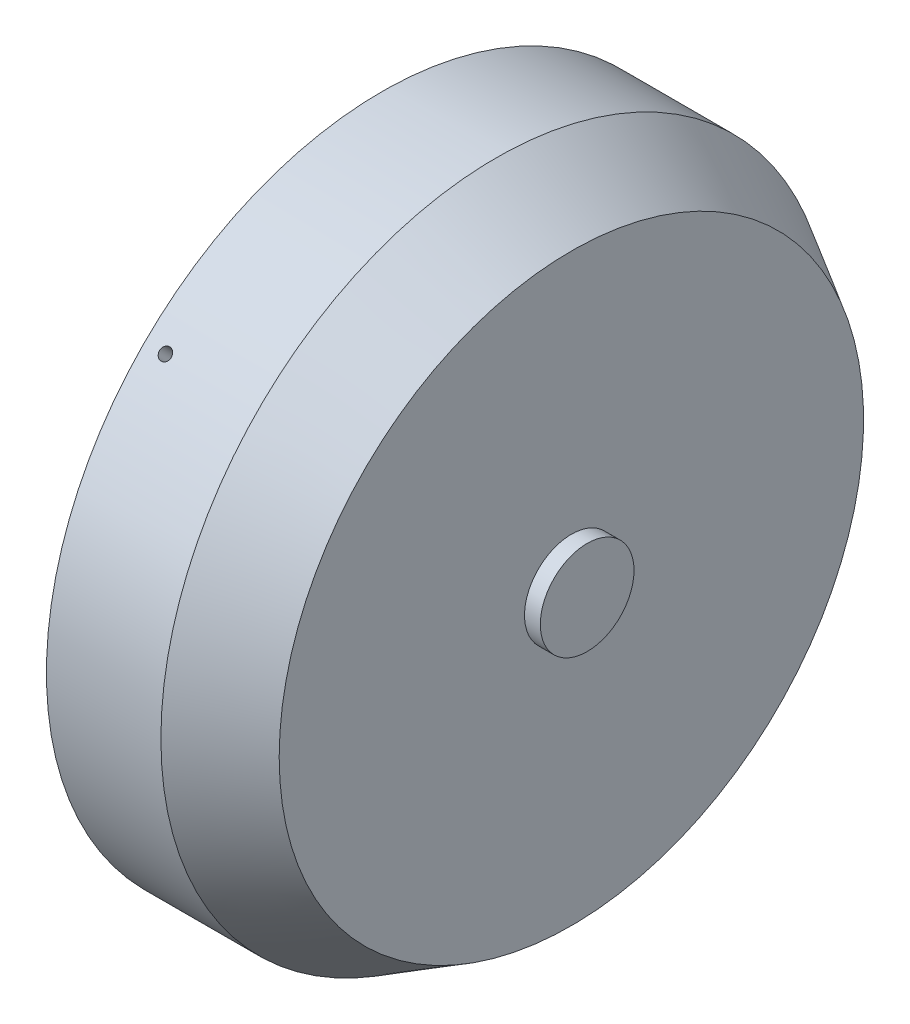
ISO-10303-21;
HEADER;
FILE_DESCRIPTION(('STEP AP214'),'2;1');
FILE_NAME('part.step','',(''),(''),'','','');
FILE_SCHEMA(('AUTOMOTIVE_DESIGN { 1 0 10303 214 1 1 1 1 }'));
ENDSEC;
DATA;
#1=APPLICATION_CONTEXT('core data for automotive mechanical design processes');
#2=APPLICATION_PROTOCOL_DEFINITION('international standard','automotive_design',2000,#1);
#3=PRODUCT_CONTEXT('',#1,'mechanical');
#4=PRODUCT('Part','Part','',(#3));
#5=PRODUCT_RELATED_PRODUCT_CATEGORY('part','',(#4));
#6=PRODUCT_DEFINITION_FORMATION('','',#4);
#7=PRODUCT_DEFINITION_CONTEXT('part definition',#1,'design');
#8=PRODUCT_DEFINITION('design','',#6,#7);
#9=PRODUCT_DEFINITION_SHAPE('','',#8);
#10=(LENGTH_UNIT() NAMED_UNIT(*) SI_UNIT(.MILLI.,.METRE.));
#11=(NAMED_UNIT(*) PLANE_ANGLE_UNIT() SI_UNIT($,.RADIAN.));
#12=(NAMED_UNIT(*) SI_UNIT($,.STERADIAN.) SOLID_ANGLE_UNIT());
#13=UNCERTAINTY_MEASURE_WITH_UNIT(LENGTH_MEASURE(1.E-05),#10,'distance_accuracy_value','');
#14=(GEOMETRIC_REPRESENTATION_CONTEXT(3) GLOBAL_UNCERTAINTY_ASSIGNED_CONTEXT((#13)) GLOBAL_UNIT_ASSIGNED_CONTEXT((#10,
#11,#12)) REPRESENTATION_CONTEXT('',''));
#15=CARTESIAN_POINT('',(0.,0.,0.));
#16=DIRECTION('',(0.,0.,1.));
#17=DIRECTION('',(1.,0.,0.));
#18=AXIS2_PLACEMENT_3D('',#15,#16,#17);
#19=CARTESIAN_POINT('',(263.57490891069,2.89050575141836E-07,-5.75217547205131E-08));
#20=DIRECTION('',(1.,0.,0.));
#21=DIRECTION('',(0.,0.,-1.));
#22=AXIS2_PLACEMENT_3D('',#19,#20,#21);
#23=PLANE('',#22);
#24=CARTESIAN_POINT('',(263.57490891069,2.89050575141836E-07,-5.75217547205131E-08));
#25=DIRECTION('',(1.,0.,0.));
#26=DIRECTION('',(0.,0.,-1.));
#27=AXIS2_PLACEMENT_3D('',#24,#25,#26);
#28=CIRCLE('',#27,5.9375);
#29=CARTESIAN_POINT('',(263.57490891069,2.89050575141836E-07,-5.93750005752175));
#30=VERTEX_POINT('',#29);
#31=EDGE_CURVE('P0_E31',#30,#30,#28,.F.);
#32=ORIENTED_EDGE('',*,*,#31,.F.);
#33=EDGE_LOOP('',(#32));
#34=FACE_BOUND('',#33,.T.);
#35=ADVANCED_FACE('P0_F26',(#34),#23,.T.);
#36=CARTESIAN_POINT('',(240.19990891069,-24.0416302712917,-24.0416306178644));
#37=DIRECTION('',(0.,0.707106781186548,0.707106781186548));
#38=DIRECTION('',(0.,-0.707106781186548,0.707106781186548));
#39=AXIS2_PLACEMENT_3D('',#36,#37,#38);
#40=PLANE('',#39);
#41=CARTESIAN_POINT('',(240.19990891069,-24.0416302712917,-24.0416306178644));
#42=DIRECTION('',(0.,-0.707106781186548,-0.707106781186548));
#43=DIRECTION('',(0.,0.707106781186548,-0.707106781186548));
#44=AXIS2_PLACEMENT_3D('',#41,#42,#43);
#45=CIRCLE('',#44,0.750000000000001);
#46=CARTESIAN_POINT('',(240.19990891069,-23.5113001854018,-24.5719607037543));
#47=VERTEX_POINT('',#46);
#48=EDGE_CURVE('P0_E105',#47,#47,#45,.T.);
#49=ORIENTED_EDGE('',*,*,#48,.T.);
#50=EDGE_LOOP('',(#49));
#51=FACE_BOUND('',#50,.T.);
#52=ADVANCED_FACE('P0_F115',(#51),#40,.F.);
#53=CARTESIAN_POINT('',(240.19990891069,-24.041630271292,24.0416305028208));
#54=DIRECTION('',(0.,0.707106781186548,-0.707106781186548));
#55=DIRECTION('',(0.,0.707106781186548,0.707106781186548));
#56=AXIS2_PLACEMENT_3D('',#53,#54,#55);
#57=PLANE('',#56);
#58=CARTESIAN_POINT('',(240.19990891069,-24.041630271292,24.0416305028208));
#59=DIRECTION('',(0.,-0.707106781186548,0.707106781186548));
#60=DIRECTION('',(0.,-0.707106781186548,-0.707106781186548));
#61=AXIS2_PLACEMENT_3D('',#58,#59,#60);
#62=CIRCLE('',#61,0.750000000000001);
#63=CARTESIAN_POINT('',(240.19990891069,-24.5719603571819,23.5113004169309));
#64=VERTEX_POINT('',#63);
#65=EDGE_CURVE('P0_E103',#64,#64,#62,.T.);
#66=ORIENTED_EDGE('',*,*,#65,.T.);
#67=EDGE_LOOP('',(#66));
#68=FACE_BOUND('',#67,.T.);
#69=ADVANCED_FACE('P0_F120',(#68),#57,.F.);
#70=CARTESIAN_POINT('',(261.57490891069,2.89050575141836E-07,-5.75217547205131E-08));
#71=DIRECTION('',(1.,0.,0.));
#72=DIRECTION('',(0.,0.,-1.));
#73=AXIS2_PLACEMENT_3D('',#70,#71,#72);
#74=CYLINDRICAL_SURFACE('',#73,5.9375);
#75=CARTESIAN_POINT('',(261.57490891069,2.89050575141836E-07,-5.75217547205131E-08));
#76=DIRECTION('',(1.,0.,0.));
#77=DIRECTION('',(0.,0.,-1.));
#78=AXIS2_PLACEMENT_3D('',#75,#76,#77);
#79=CIRCLE('',#78,5.9375);
#80=CARTESIAN_POINT('',(261.57490891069,2.89050575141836E-07,-5.93750005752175));
#81=VERTEX_POINT('',#80);
#82=EDGE_CURVE('P0_E100',#81,#81,#79,.F.);
#83=ORIENTED_EDGE('',*,*,#82,.F.);
#84=EDGE_LOOP('',(#83));
#85=FACE_BOUND('',#84,.T.);
#86=ORIENTED_EDGE('',*,*,#31,.T.);
#87=EDGE_LOOP('',(#86));
#88=FACE_BOUND('',#87,.T.);
#89=ADVANCED_FACE('P0_F112',(#85,#88),#74,.T.);
#90=CARTESIAN_POINT('',(240.19990891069,-24.0416302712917,-24.0416306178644));
#91=DIRECTION('',(0.,-0.707106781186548,-0.707106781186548));
#92=DIRECTION('',(0.,0.707106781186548,-0.707106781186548));
#93=AXIS2_PLACEMENT_3D('',#90,#91,#92);
#94=CYLINDRICAL_SURFACE('',#93,0.750000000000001);
#95=ORIENTED_EDGE('',*,*,#48,.F.);
#96=EDGE_LOOP('',(#95));
#97=FACE_BOUND('',#96,.T.);
#98=CARTESIAN_POINT('',(239.44990891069,-30.0520379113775,-30.05203825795));
#99=CARTESIAN_POINT('',(239.449910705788,-30.0818267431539,-30.0222493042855));
#100=CARTESIAN_POINT('',(239.453470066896,-30.1115906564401,-29.9923959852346));
#101=CARTESIAN_POINT('',(239.467618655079,-30.1702107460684,-29.9334278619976));
#102=CARTESIAN_POINT('',(239.478215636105,-30.1990658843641,-29.9043139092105));
#103=CARTESIAN_POINT('',(239.506137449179,-30.25502580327,-29.8476964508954));
#104=CARTESIAN_POINT('',(239.523459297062,-30.2821313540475,-29.8201922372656));
#105=CARTESIAN_POINT('',(239.564335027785,-30.3338441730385,-29.7675871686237));
#106=CARTESIAN_POINT('',(239.587887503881,-30.3584520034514,-29.7424857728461));
#107=CARTESIAN_POINT('',(239.640562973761,-30.4045046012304,-29.6954065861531));
#108=CARTESIAN_POINT('',(239.669687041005,-30.4259487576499,-29.6734293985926));
#109=CARTESIAN_POINT('',(239.7326775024,-30.465082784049,-29.633249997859));
#110=CARTESIAN_POINT('',(239.766544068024,-30.4827725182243,-29.6150479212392));
#111=CARTESIAN_POINT('',(239.838059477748,-30.5139170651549,-29.5829571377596));
#112=CARTESIAN_POINT('',(239.875708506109,-30.5273716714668,-29.569068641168));
#113=CARTESIAN_POINT('',(239.95371871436,-30.5496809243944,-29.5460190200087));
#114=CARTESIAN_POINT('',(239.994079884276,-30.5585355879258,-29.5368578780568));
#115=CARTESIAN_POINT('',(240.076364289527,-30.571405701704,-29.5235368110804));
#116=CARTESIAN_POINT('',(240.118287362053,-30.5754216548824,-29.5193763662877));
#117=CARTESIAN_POINT('',(240.202509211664,-30.5785079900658,-29.5161792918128));
#118=CARTESIAN_POINT('',(240.244807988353,-30.5775783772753,-29.5171426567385));
#119=CARTESIAN_POINT('',(240.328575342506,-30.5707989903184,-29.5241639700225));
#120=CARTESIAN_POINT('',(240.370044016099,-30.5649497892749,-29.5302213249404));
#121=CARTESIAN_POINT('',(240.450979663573,-30.5484892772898,-29.5472490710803));
#122=CARTESIAN_POINT('',(240.490446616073,-30.5378779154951,-29.558219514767));
#123=CARTESIAN_POINT('',(240.566262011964,-30.5121780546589,-29.5847480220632));
#124=CARTESIAN_POINT('',(240.602610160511,-30.4970891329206,-29.6003065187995));
#125=CARTESIAN_POINT('',(240.671149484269,-30.4628444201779,-29.6355478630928));
#126=CARTESIAN_POINT('',(240.703341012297,-30.4436889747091,-29.6552303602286));
#127=CARTESIAN_POINT('',(240.762655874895,-30.4018332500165,-29.6981382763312));
#128=CARTESIAN_POINT('',(240.789779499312,-30.3791331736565,-29.7213634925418));
#129=CARTESIAN_POINT('',(240.83820276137,-30.3307963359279,-29.7706897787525));
#130=CARTESIAN_POINT('',(240.859499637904,-30.3051581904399,-29.7967922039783));
#131=CARTESIAN_POINT('',(240.895662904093,-30.2516446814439,-29.8511211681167));
#132=CARTESIAN_POINT('',(240.910523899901,-30.2237674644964,-29.8793494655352));
#133=CARTESIAN_POINT('',(240.933340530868,-30.1666156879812,-29.93704934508));
#134=CARTESIAN_POINT('',(240.941310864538,-30.1373442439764,-29.9665181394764));
#135=CARTESIAN_POINT('',(240.948521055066,-30.0892898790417,-30.0147516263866));
#136=CARTESIAN_POINT('',(240.94991107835,-30.0706779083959,-30.033398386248));
#137=CARTESIAN_POINT('',(240.949905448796,-30.0222686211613,-30.0818073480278));
#138=CARTESIAN_POINT('',(240.946351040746,-29.9924278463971,-30.1115588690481));
#139=CARTESIAN_POINT('',(240.93221061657,-29.9334566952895,-30.1701822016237));
#140=CARTESIAN_POINT('',(240.921609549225,-29.9043279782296,-30.1990519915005));
#141=CARTESIAN_POINT('',(240.893678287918,-29.8476923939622,-30.2550298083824));
#142=CARTESIAN_POINT('',(240.876353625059,-29.8201842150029,-30.2821392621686));
#143=CARTESIAN_POINT('',(240.835476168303,-29.7675796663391,-30.333851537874));
#144=CARTESIAN_POINT('',(240.81192653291,-29.7424820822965,-30.3584556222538));
#145=CARTESIAN_POINT('',(240.759258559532,-29.6954095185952,-30.4045017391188));
#146=CARTESIAN_POINT('',(240.73013913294,-29.6734351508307,-30.4259431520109));
#147=CARTESIAN_POINT('',(240.667149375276,-29.6332546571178,-30.4650782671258));
#148=CARTESIAN_POINT('',(240.633277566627,-29.6150497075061,-30.4827707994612));
#149=CARTESIAN_POINT('',(240.561739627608,-29.5829479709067,-30.5139259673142));
#150=CARTESIAN_POINT('',(240.52407173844,-29.5690531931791,-30.5273866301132));
#151=CARTESIAN_POINT('',(240.446049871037,-29.5460081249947,-30.5496914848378));
#152=CARTESIAN_POINT('',(240.405698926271,-29.5368525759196,-30.5585407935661));
#153=CARTESIAN_POINT('',(240.337588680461,-29.5258239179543,-30.5691959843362));
#154=CARTESIAN_POINT('',(240.310258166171,-29.5225300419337,-30.5723766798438));
#155=CARTESIAN_POINT('',(240.255258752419,-29.5181316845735,-30.576623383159));
#156=CARTESIAN_POINT('',(240.227589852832,-29.517027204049,-30.5776893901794));
#157=CARTESIAN_POINT('',(240.157781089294,-29.5170294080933,-30.5776873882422));
#158=CARTESIAN_POINT('',(240.115625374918,-29.5195909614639,-30.5752152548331));
#159=CARTESIAN_POINT('',(240.03247795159,-29.5297695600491,-30.5653847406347));
#160=CARTESIAN_POINT('',(239.991487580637,-29.5373921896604,-30.5580209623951));
#161=CARTESIAN_POINT('',(239.911882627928,-29.557464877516,-30.538605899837));
#162=CARTESIAN_POINT('',(239.873267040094,-29.5699128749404,-30.5265566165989));
#163=CARTESIAN_POINT('',(239.799503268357,-29.5992627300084,-30.4980990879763));
#164=CARTESIAN_POINT('',(239.764354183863,-29.6161634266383,-30.481691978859));
#165=CARTESIAN_POINT('',(239.698504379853,-29.6539213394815,-30.444960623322));
#166=CARTESIAN_POINT('',(239.667804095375,-29.6747789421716,-30.4246359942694));
#167=CARTESIAN_POINT('',(239.611719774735,-29.7198422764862,-30.3806180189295));
#168=CARTESIAN_POINT('',(239.586337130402,-29.744048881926,-30.3569237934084));
#169=CARTESIAN_POINT('',(239.541608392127,-29.7951063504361,-30.3068128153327));
#170=CARTESIAN_POINT('',(239.522265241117,-29.8219584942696,-30.2803947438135));
#171=CARTESIAN_POINT('',(239.490197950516,-29.8774983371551,-30.2255950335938));
#172=CARTESIAN_POINT('',(239.477466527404,-29.9061839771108,-30.19721559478));
#173=CARTESIAN_POINT('',(239.462133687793,-29.9545320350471,-30.1492409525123));
#174=CARTESIAN_POINT('',(239.457555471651,-29.9739142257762,-30.1299719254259));
#175=CARTESIAN_POINT('',(239.451442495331,-30.0128805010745,-30.0911572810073));
#176=CARTESIAN_POINT('',(239.449907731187,-30.0324645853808,-30.0716116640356));
#177=CARTESIAN_POINT('',(239.44990891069,-30.0520379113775,-30.05203825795));
#178=B_SPLINE_CURVE_WITH_KNOTS('',3,(#98,#99,#100,#101,#102,#103,#104,#105,#106,#107,#108,#109,
#110,#111,#112,#113,#114,#115,#116,#117,#118,#119,#120,#121,#122,#123,#124,#125,#126,#127,#128,
#129,#130,#131,#132,#133,#134,#135,#136,#137,#138,#139,#140,#141,#142,#143,#144,#145,#146,#147,
#148,#149,#150,#151,#152,#153,#154,#155,#156,#157,#158,#159,#160,#161,#162,#163,#164,#165,#166,
#167,#168,#169,#170,#171,#172,#173,#174,#175,#176,#177),.UNSPECIFIED.,.T.,.F.,(4,2,2,2,2,2,2,2,
2,2,2,2,2,2,2,2,2,2,2,2,2,2,2,2,2,2,2,2,2,2,2,2,2,2,2,2,2,2,2,4),(0.,0.126282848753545,
0.252705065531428,0.379071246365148,0.505408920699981,0.631770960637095,0.758137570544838,
0.884510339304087,1.0108826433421,1.13724181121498,1.26360084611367,1.38994516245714,
1.51629082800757,1.64264842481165,1.76899528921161,1.89533492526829,2.02173432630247,
2.1482394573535,2.27447406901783,2.35350484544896,2.47972214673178,2.60620991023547,
2.73259383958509,2.85891376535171,2.98525840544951,3.11164241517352,3.23808525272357,
3.36438748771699,3.44736410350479,3.53034075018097,3.65662349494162,3.78304581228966,
3.9094141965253,4.03574966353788,4.16209747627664,4.28847831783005,4.41492064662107,
4.54122338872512,4.62420007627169,4.7071766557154),.UNSPECIFIED.);
#179=CARTESIAN_POINT('',(239.44990891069,-30.0520379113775,-30.05203825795));
#180=VERTEX_POINT('',#179);
#181=EDGE_CURVE('P0_E94',#180,#180,#178,.T.);
#182=ORIENTED_EDGE('',*,*,#181,.F.);
#183=EDGE_LOOP('',(#182));
#184=FACE_BOUND('',#183,.T.);
#185=ADVANCED_FACE('P0_F82',(#97,#184),#94,.F.);
#186=CARTESIAN_POINT('',(240.19990891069,-24.041630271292,24.0416305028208));
#187=DIRECTION('',(0.,-0.707106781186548,0.707106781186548));
#188=DIRECTION('',(0.,-0.707106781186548,-0.707106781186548));
#189=AXIS2_PLACEMENT_3D('',#186,#187,#188);
#190=CYLINDRICAL_SURFACE('',#189,0.750000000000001);
#191=ORIENTED_EDGE('',*,*,#65,.F.);
#192=EDGE_LOOP('',(#191));
#193=FACE_BOUND('',#192,.T.);
#194=CARTESIAN_POINT('',(239.44990891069,-30.0520379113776,30.0520381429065));
#195=CARTESIAN_POINT('',(239.449910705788,-30.0222489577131,30.0818269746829));
#196=CARTESIAN_POINT('',(239.453470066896,-29.9923956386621,30.111590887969));
#197=CARTESIAN_POINT('',(239.467618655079,-29.9334275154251,30.1702109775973));
#198=CARTESIAN_POINT('',(239.478215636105,-29.904313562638,30.199066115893));
#199=CARTESIAN_POINT('',(239.506137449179,-29.8476961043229,30.2550260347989));
#200=CARTESIAN_POINT('',(239.523459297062,-29.8201918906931,30.2821315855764));
#201=CARTESIAN_POINT('',(239.564335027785,-29.7675868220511,30.3338444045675));
#202=CARTESIAN_POINT('',(239.587887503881,-29.7424854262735,30.3584522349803));
#203=CARTESIAN_POINT('',(239.640562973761,-29.6954062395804,30.4045048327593));
#204=CARTESIAN_POINT('',(239.669687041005,-29.67342905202,30.4259489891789));
#205=CARTESIAN_POINT('',(239.7326775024,-29.6332496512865,30.465083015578));
#206=CARTESIAN_POINT('',(239.766544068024,-29.6150475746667,30.4827727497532));
#207=CARTESIAN_POINT('',(239.838059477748,-29.5829567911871,30.5139172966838));
#208=CARTESIAN_POINT('',(239.875708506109,-29.5690682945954,30.5273719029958));
#209=CARTESIAN_POINT('',(239.95371871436,-29.5460186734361,30.5496811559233));
#210=CARTESIAN_POINT('',(239.994079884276,-29.5368575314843,30.5585358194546));
#211=CARTESIAN_POINT('',(240.076364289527,-29.5235364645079,30.5714059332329));
#212=CARTESIAN_POINT('',(240.118287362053,-29.5193760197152,30.5754218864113));
#213=CARTESIAN_POINT('',(240.202509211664,-29.5161789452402,30.5785082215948));
#214=CARTESIAN_POINT('',(240.244807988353,-29.517142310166,30.5775786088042));
#215=CARTESIAN_POINT('',(240.328575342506,-29.52416362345,30.5707992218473));
#216=CARTESIAN_POINT('',(240.370044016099,-29.5302209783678,30.5649500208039));
#217=CARTESIAN_POINT('',(240.450979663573,-29.5472487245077,30.5484895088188));
#218=CARTESIAN_POINT('',(240.490446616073,-29.5582191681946,30.537878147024));
#219=CARTESIAN_POINT('',(240.566262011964,-29.5847476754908,30.5121782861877));
#220=CARTESIAN_POINT('',(240.602610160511,-29.600306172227,30.4970893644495));
#221=CARTESIAN_POINT('',(240.671149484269,-29.6355475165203,30.4628446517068));
#222=CARTESIAN_POINT('',(240.703341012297,-29.6552300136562,30.4436892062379));
#223=CARTESIAN_POINT('',(240.762655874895,-29.6981379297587,30.4018334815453));
#224=CARTESIAN_POINT('',(240.789779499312,-29.7213631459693,30.3791334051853));
#225=CARTESIAN_POINT('',(240.83820276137,-29.77068943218,30.3307965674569));
#226=CARTESIAN_POINT('',(240.859499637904,-29.7967918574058,30.305158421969));
#227=CARTESIAN_POINT('',(240.895662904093,-29.8511208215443,30.251644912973));
#228=CARTESIAN_POINT('',(240.910523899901,-29.8793491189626,30.2237676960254));
#229=CARTESIAN_POINT('',(240.933340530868,-29.9370489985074,30.1666159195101));
#230=CARTESIAN_POINT('',(240.941310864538,-29.9665177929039,30.1373444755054));
#231=CARTESIAN_POINT('',(240.948521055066,-30.0147512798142,30.0892901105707));
#232=CARTESIAN_POINT('',(240.94991107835,-30.0333980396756,30.0706781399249));
#233=CARTESIAN_POINT('',(240.949905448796,-30.0818070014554,30.0222688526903));
#234=CARTESIAN_POINT('',(240.946351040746,-30.1115585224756,29.9924280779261));
#235=CARTESIAN_POINT('',(240.93221061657,-30.1701818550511,29.9334569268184));
#236=CARTESIAN_POINT('',(240.921609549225,-30.1990516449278,29.9043282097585));
#237=CARTESIAN_POINT('',(240.893678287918,-30.2550294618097,29.847692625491));
#238=CARTESIAN_POINT('',(240.876353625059,-30.2821389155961,29.8201844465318));
#239=CARTESIAN_POINT('',(240.835476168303,-30.3338511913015,29.7675798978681));
#240=CARTESIAN_POINT('',(240.81192653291,-30.3584552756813,29.7424823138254));
#241=CARTESIAN_POINT('',(240.759258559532,-30.4045013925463,29.6954097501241));
#242=CARTESIAN_POINT('',(240.73013913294,-30.4259428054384,29.6734353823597));
#243=CARTESIAN_POINT('',(240.667149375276,-30.4650779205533,29.6332548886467));
#244=CARTESIAN_POINT('',(240.633277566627,-30.4827704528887,29.615049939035));
#245=CARTESIAN_POINT('',(240.561739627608,-30.5139256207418,29.5829482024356));
#246=CARTESIAN_POINT('',(240.52407173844,-30.5273862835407,29.5690534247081));
#247=CARTESIAN_POINT('',(240.446049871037,-30.5496911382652,29.5460083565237));
#248=CARTESIAN_POINT('',(240.405698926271,-30.5585404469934,29.5368528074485));
#249=CARTESIAN_POINT('',(240.337588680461,-30.5691956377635,29.5258241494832));
#250=CARTESIAN_POINT('',(240.310258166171,-30.5723763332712,29.5225302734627));
#251=CARTESIAN_POINT('',(240.255258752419,-30.5766230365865,29.5181319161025));
#252=CARTESIAN_POINT('',(240.227589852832,-30.5776890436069,29.5170274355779));
#253=CARTESIAN_POINT('',(240.157781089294,-30.5776870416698,29.5170296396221));
#254=CARTESIAN_POINT('',(240.115625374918,-30.5752149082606,29.5195911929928));
#255=CARTESIAN_POINT('',(240.03247795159,-30.5653843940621,29.5297697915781));
#256=CARTESIAN_POINT('',(239.991487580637,-30.5580206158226,29.5373924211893));
#257=CARTESIAN_POINT('',(239.911882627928,-30.5386055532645,29.5574651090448));
#258=CARTESIAN_POINT('',(239.873267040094,-30.5265562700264,29.5699131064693));
#259=CARTESIAN_POINT('',(239.799503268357,-30.4980987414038,29.5992629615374));
#260=CARTESIAN_POINT('',(239.764354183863,-30.4816916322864,29.6161636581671));
#261=CARTESIAN_POINT('',(239.698504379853,-30.4449602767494,29.6539215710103));
#262=CARTESIAN_POINT('',(239.667804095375,-30.4246356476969,29.6747791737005));
#263=CARTESIAN_POINT('',(239.611719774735,-30.3806176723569,29.7198425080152));
#264=CARTESIAN_POINT('',(239.586337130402,-30.3569234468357,29.7440491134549));
#265=CARTESIAN_POINT('',(239.541608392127,-30.30681246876,29.7951065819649));
#266=CARTESIAN_POINT('',(239.522265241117,-30.2803943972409,29.8219587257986));
#267=CARTESIAN_POINT('',(239.490197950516,-30.2255946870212,29.8774985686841));
#268=CARTESIAN_POINT('',(239.477466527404,-30.1972152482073,29.9061842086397));
#269=CARTESIAN_POINT('',(239.462133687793,-30.1492406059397,29.954532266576));
#270=CARTESIAN_POINT('',(239.457555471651,-30.1299715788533,29.9739144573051));
#271=CARTESIAN_POINT('',(239.451442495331,-30.0911569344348,30.0128807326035));
#272=CARTESIAN_POINT('',(239.449907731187,-30.0716113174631,30.0324648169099));
#273=CARTESIAN_POINT('',(239.44990891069,-30.0520379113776,30.0520381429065));
#274=B_SPLINE_CURVE_WITH_KNOTS('',3,(#194,#195,#196,#197,#198,#199,#200,#201,#202,#203,#204,
#205,#206,#207,#208,#209,#210,#211,#212,#213,#214,#215,#216,#217,#218,#219,#220,#221,#222,#223,
#224,#225,#226,#227,#228,#229,#230,#231,#232,#233,#234,#235,#236,#237,#238,#239,#240,#241,#242,
#243,#244,#245,#246,#247,#248,#249,#250,#251,#252,#253,#254,#255,#256,#257,#258,#259,#260,#261,
#262,#263,#264,#265,#266,#267,#268,#269,#270,#271,#272,#273),.UNSPECIFIED.,.T.,.F.,(4,2,2,2,2,2,
2,2,2,2,2,2,2,2,2,2,2,2,2,2,2,2,2,2,2,2,2,2,2,2,2,2,2,2,2,2,2,2,2,4),(0.,0.126282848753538,
0.25270506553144,0.379071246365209,0.505408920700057,0.631770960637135,0.758137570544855,
0.884510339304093,1.01088264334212,1.13724181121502,1.26360084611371,1.3899451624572,
1.51629082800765,1.64264842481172,1.7689952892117,1.89533492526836,2.02173432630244,
2.14823945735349,2.27447406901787,2.35350484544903,2.4797221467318,2.60620991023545,
2.73259383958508,2.85891376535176,2.98525840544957,3.11164241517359,3.23808525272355,
3.36438748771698,3.44736410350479,3.53034075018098,3.65662349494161,3.78304581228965,
3.90941419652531,4.03574966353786,4.16209747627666,4.28847831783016,4.41492064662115,
4.54122338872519,4.62420007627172,4.70717665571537),.UNSPECIFIED.);
#275=CARTESIAN_POINT('',(239.44990891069,-30.0520379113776,30.0520381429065));
#276=VERTEX_POINT('',#275);
#277=EDGE_CURVE('P0_E87',#276,#276,#274,.T.);
#278=ORIENTED_EDGE('',*,*,#277,.F.);
#279=EDGE_LOOP('',(#278));
#280=FACE_BOUND('',#279,.T.);
#281=ADVANCED_FACE('P0_F77',(#193,#280),#190,.F.);
#282=CARTESIAN_POINT('',(261.57490891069,2.8905054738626E-07,-18.507586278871));
#283=DIRECTION('',(1.,0.,0.));
#284=DIRECTION('',(0.,0.,-1.));
#285=AXIS2_PLACEMENT_3D('',#282,#283,#284);
#286=PLANE('',#285);
#287=CARTESIAN_POINT('',(261.57490891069,2.89050575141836E-07,-5.75217547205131E-08));
#288=DIRECTION('',(-1.,0.,0.));
#289=DIRECTION('',(0.,0.,1.));
#290=AXIS2_PLACEMENT_3D('',#287,#288,#289);
#291=CIRCLE('',#290,37.0151724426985);
#292=CARTESIAN_POINT('',(261.57490891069,2.89050575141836E-07,37.0151723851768));
#293=VERTEX_POINT('',#292);
#294=EDGE_CURVE('P0_E93',#293,#293,#291,.T.);
#295=ORIENTED_EDGE('',*,*,#294,.F.);
#296=EDGE_LOOP('',(#295));
#297=FACE_BOUND('',#296,.T.);
#298=ORIENTED_EDGE('',*,*,#82,.T.);
#299=EDGE_LOOP('',(#298));
#300=FACE_BOUND('',#299,.T.);
#301=ADVANCED_FACE('P0_F73',(#297,#300),#286,.T.);
#302=CARTESIAN_POINT('',(240.19990891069,24.0416308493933,-24.0416306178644));
#303=DIRECTION('',(0.,-0.707106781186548,0.707106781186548));
#304=DIRECTION('',(0.,-0.707106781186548,-0.707106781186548));
#305=AXIS2_PLACEMENT_3D('',#302,#303,#304);
#306=PLANE('',#305);
#307=CARTESIAN_POINT('',(240.19990891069,24.0416308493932,-24.0416306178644));
#308=DIRECTION('',(0.,0.707106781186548,-0.707106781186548));
#309=DIRECTION('',(0.,0.707106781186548,0.707106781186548));
#310=AXIS2_PLACEMENT_3D('',#307,#308,#309);
#311=CIRCLE('',#310,0.750000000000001);
#312=CARTESIAN_POINT('',(240.19990891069,24.5719609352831,-23.5113005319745));
#313=VERTEX_POINT('',#312);
#314=EDGE_CURVE('P0_E246',#313,#313,#311,.T.);
#315=ORIENTED_EDGE('',*,*,#314,.T.);
#316=EDGE_LOOP('',(#315));
#317=FACE_BOUND('',#316,.T.);
#318=ADVANCED_FACE('P0_F69',(#317),#306,.F.);
#319=CARTESIAN_POINT('',(240.19990891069,24.0416308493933,24.0416305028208));
#320=DIRECTION('',(0.,-0.707106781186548,-0.707106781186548));
#321=DIRECTION('',(0.,0.707106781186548,-0.707106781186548));
#322=AXIS2_PLACEMENT_3D('',#319,#320,#321);
#323=PLANE('',#322);
#324=CARTESIAN_POINT('',(240.19990891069,24.0416308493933,24.0416305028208));
#325=DIRECTION('',(0.,0.707106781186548,0.707106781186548));
#326=DIRECTION('',(0.,-0.707106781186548,0.707106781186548));
#327=AXIS2_PLACEMENT_3D('',#324,#325,#326);
#328=CIRCLE('',#327,0.750000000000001);
#329=CARTESIAN_POINT('',(240.19990891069,23.5113007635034,24.5719605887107));
#330=VERTEX_POINT('',#329);
#331=EDGE_CURVE('P0_E244',#330,#330,#328,.T.);
#332=ORIENTED_EDGE('',*,*,#331,.T.);
#333=EDGE_LOOP('',(#332));
#334=FACE_BOUND('',#333,.T.);
#335=ADVANCED_FACE('P0_F65',(#334),#323,.F.);
#336=CARTESIAN_POINT('',(237.57490891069,2.89050644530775E-07,-21.2500000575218));
#337=DIRECTION('',(-1.,0.,0.));
#338=DIRECTION('',(0.,0.,1.));
#339=AXIS2_PLACEMENT_3D('',#336,#337,#338);
#340=PLANE('',#339);
#341=CARTESIAN_POINT('',(237.57490891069,2.89050658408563E-07,-5.75217824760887E-08));
#342=DIRECTION('',(1.,0.,0.));
#343=DIRECTION('',(0.,0.,-1.));
#344=AXIS2_PLACEMENT_3D('',#341,#342,#343);
#345=CIRCLE('',#344,42.5);
#346=CARTESIAN_POINT('',(237.57490891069,2.89050658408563E-07,-42.5000000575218));
#347=VERTEX_POINT('',#346);
#348=EDGE_CURVE('P0_E128',#347,#347,#345,.T.);
#349=ORIENTED_EDGE('',*,*,#348,.F.);
#350=EDGE_LOOP('',(#349));
#351=FACE_BOUND('',#350,.T.);
#352=ADVANCED_FACE('P0_F61',(#351),#340,.T.);
#353=CARTESIAN_POINT('',(252.07490891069,2.89050602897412E-07,-5.75217581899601E-08));
#354=DIRECTION('',(-1.,0.,0.));
#355=DIRECTION('',(0.,0.,1.));
#356=AXIS2_PLACEMENT_3D('',#353,#354,#355);
#357=CONICAL_SURFACE('',#356,42.5,0.523598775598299);
#358=CARTESIAN_POINT('',(252.07490891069,2.89050602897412E-07,-5.75217581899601E-08));
#359=DIRECTION('',(1.,0.,0.));
#360=DIRECTION('',(0.,0.,-1.));
#361=AXIS2_PLACEMENT_3D('',#358,#359,#360);
#362=CIRCLE('',#361,42.5);
#363=CARTESIAN_POINT('',(252.07490891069,2.89050602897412E-07,-42.5000000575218));
#364=VERTEX_POINT('',#363);
#365=EDGE_CURVE('P0_E40',#364,#364,#362,.F.);
#366=ORIENTED_EDGE('',*,*,#365,.F.);
#367=EDGE_LOOP('',(#366));
#368=FACE_BOUND('',#367,.T.);
#369=ORIENTED_EDGE('',*,*,#294,.T.);
#370=EDGE_LOOP('',(#369));
#371=FACE_BOUND('',#370,.T.);
#372=ADVANCED_FACE('P0_F57',(#368,#371),#357,.T.);
#373=CARTESIAN_POINT('',(240.19990891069,24.0416308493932,-24.0416306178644));
#374=DIRECTION('',(0.,0.707106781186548,-0.707106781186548));
#375=DIRECTION('',(0.,0.707106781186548,0.707106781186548));
#376=AXIS2_PLACEMENT_3D('',#373,#374,#375);
#377=CYLINDRICAL_SURFACE('',#376,0.750000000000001);
#378=ORIENTED_EDGE('',*,*,#314,.F.);
#379=EDGE_LOOP('',(#378));
#380=FACE_BOUND('',#379,.T.);
#381=CARTESIAN_POINT('',(240.19990891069,30.5776888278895,-29.5170284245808));
#382=CARTESIAN_POINT('',(240.157781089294,30.5776876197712,-29.5170297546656));
#383=CARTESIAN_POINT('',(240.115625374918,30.5752154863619,-29.5195913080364));
#384=CARTESIAN_POINT('',(240.03247795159,30.5653849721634,-29.5297699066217));
#385=CARTESIAN_POINT('',(239.991487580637,30.5580211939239,-29.5373925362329));
#386=CARTESIAN_POINT('',(239.911882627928,30.5386061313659,-29.5574652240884));
#387=CARTESIAN_POINT('',(239.873267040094,30.5265568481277,-29.5699132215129));
#388=CARTESIAN_POINT('',(239.799503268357,30.4980993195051,-29.599263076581));
#389=CARTESIAN_POINT('',(239.764354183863,30.4816922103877,-29.6161637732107));
#390=CARTESIAN_POINT('',(239.698504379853,30.4449608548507,-29.6539216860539));
#391=CARTESIAN_POINT('',(239.667804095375,30.4246362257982,-29.6747792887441));
#392=CARTESIAN_POINT('',(239.611719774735,30.3806182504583,-29.7198426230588));
#393=CARTESIAN_POINT('',(239.586337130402,30.3569240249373,-29.7440492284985));
#394=CARTESIAN_POINT('',(239.541608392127,30.3068130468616,-29.7951066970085));
#395=CARTESIAN_POINT('',(239.522265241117,30.2803949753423,-29.8219588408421));
#396=CARTESIAN_POINT('',(239.490197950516,30.2255952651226,-29.8774986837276));
#397=CARTESIAN_POINT('',(239.477466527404,30.1972158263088,-29.9061843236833));
#398=CARTESIAN_POINT('',(239.462133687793,30.1492411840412,-29.9545323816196));
#399=CARTESIAN_POINT('',(239.457555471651,30.1299721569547,-29.9739145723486));
#400=CARTESIAN_POINT('',(239.451442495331,30.0911575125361,-30.0128808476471));
#401=CARTESIAN_POINT('',(239.449907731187,30.0716118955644,-30.0324649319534));
#402=CARTESIAN_POINT('',(239.449910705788,30.0222495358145,-30.0818270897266));
#403=CARTESIAN_POINT('',(239.453470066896,29.9923962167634,-30.1115910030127));
#404=CARTESIAN_POINT('',(239.467618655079,29.9334280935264,-30.1702110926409));
#405=CARTESIAN_POINT('',(239.478215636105,29.9043141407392,-30.1990662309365));
#406=CARTESIAN_POINT('',(239.506137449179,29.8476966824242,-30.2550261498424));
#407=CARTESIAN_POINT('',(239.523459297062,29.8201924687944,-30.28213170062));
#408=CARTESIAN_POINT('',(239.564335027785,29.7675874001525,-30.333844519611));
#409=CARTESIAN_POINT('',(239.587887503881,29.742486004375,-30.3584523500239));
#410=CARTESIAN_POINT('',(239.640562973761,29.6954068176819,-30.4045049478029));
#411=CARTESIAN_POINT('',(239.669687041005,29.6734296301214,-30.4259491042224));
#412=CARTESIAN_POINT('',(239.7326775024,29.6332502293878,-30.4650831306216));
#413=CARTESIAN_POINT('',(239.766544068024,29.615048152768,-30.4827728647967));
#414=CARTESIAN_POINT('',(239.838059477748,29.5829573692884,-30.5139174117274));
#415=CARTESIAN_POINT('',(239.875708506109,29.5690688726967,-30.5273720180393));
#416=CARTESIAN_POINT('',(239.95371871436,29.5460192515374,-30.549681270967));
#417=CARTESIAN_POINT('',(239.994079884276,29.5368581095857,-30.5585359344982));
#418=CARTESIAN_POINT('',(240.076364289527,29.5235370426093,-30.5714060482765));
#419=CARTESIAN_POINT('',(240.118287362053,29.5193765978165,-30.575422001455));
#420=CARTESIAN_POINT('',(240.202509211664,29.5161795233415,-30.5785083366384));
#421=CARTESIAN_POINT('',(240.244807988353,29.5171428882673,-30.5775787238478));
#422=CARTESIAN_POINT('',(240.328575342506,29.5241642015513,-30.5707993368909));
#423=CARTESIAN_POINT('',(240.370044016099,29.5302215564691,-30.5649501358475));
#424=CARTESIAN_POINT('',(240.450979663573,29.547249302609,-30.5484896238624));
#425=CARTESIAN_POINT('',(240.490446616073,29.5582197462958,-30.5378782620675));
#426=CARTESIAN_POINT('',(240.566262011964,29.584748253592,-30.5121784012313));
#427=CARTESIAN_POINT('',(240.602610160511,29.6003067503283,-30.4970894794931));
#428=CARTESIAN_POINT('',(240.671149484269,29.6355480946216,-30.4628447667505));
#429=CARTESIAN_POINT('',(240.703341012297,29.6552305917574,-30.4436893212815));
#430=CARTESIAN_POINT('',(240.762655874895,29.69813850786,-30.4018335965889));
#431=CARTESIAN_POINT('',(240.789779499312,29.7213637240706,-30.379133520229));
#432=CARTESIAN_POINT('',(240.83820276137,29.7706900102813,-30.3307966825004));
#433=CARTESIAN_POINT('',(240.859499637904,29.796792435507,-30.3051585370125));
#434=CARTESIAN_POINT('',(240.895662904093,29.8511213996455,-30.2516450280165));
#435=CARTESIAN_POINT('',(240.910523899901,29.8793496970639,-30.2237678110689));
#436=CARTESIAN_POINT('',(240.933340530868,29.9370495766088,-30.1666160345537));
#437=CARTESIAN_POINT('',(240.941310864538,29.9665183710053,-30.1373445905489));
#438=CARTESIAN_POINT('',(240.948521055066,30.0147518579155,-30.0892902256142));
#439=CARTESIAN_POINT('',(240.94991107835,30.0333986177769,-30.0706782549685));
#440=CARTESIAN_POINT('',(240.949905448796,30.0818075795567,-30.0222689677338));
#441=CARTESIAN_POINT('',(240.946351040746,30.1115591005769,-29.9924281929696));
#442=CARTESIAN_POINT('',(240.93221061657,30.1701824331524,-29.933457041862));
#443=CARTESIAN_POINT('',(240.921609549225,30.1990522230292,-29.904328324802));
#444=CARTESIAN_POINT('',(240.893678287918,30.2550300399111,-29.8476927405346));
#445=CARTESIAN_POINT('',(240.876353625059,30.2821394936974,-29.8201845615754));
#446=CARTESIAN_POINT('',(240.835476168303,30.3338517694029,-29.7675800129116));
#447=CARTESIAN_POINT('',(240.81192653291,30.3584558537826,-29.7424824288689));
#448=CARTESIAN_POINT('',(240.759258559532,30.4045019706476,-29.6954098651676));
#449=CARTESIAN_POINT('',(240.73013913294,30.4259433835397,-29.6734354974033));
#450=CARTESIAN_POINT('',(240.667149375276,30.4650784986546,-29.6332550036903));
#451=CARTESIAN_POINT('',(240.633277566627,30.48277103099,-29.6150500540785));
#452=CARTESIAN_POINT('',(240.561739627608,30.5139261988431,-29.5829483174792));
#453=CARTESIAN_POINT('',(240.52407173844,30.527386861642,-29.5690535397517));
#454=CARTESIAN_POINT('',(240.446049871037,30.5496917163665,-29.5460084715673));
#455=CARTESIAN_POINT('',(240.405698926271,30.558541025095,-29.5368529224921));
#456=CARTESIAN_POINT('',(240.337588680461,30.569196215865,-29.5258242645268));
#457=CARTESIAN_POINT('',(240.310258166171,30.5723769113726,-29.5225303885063));
#458=CARTESIAN_POINT('',(240.255258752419,30.5766236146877,-29.5181320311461));
#459=CARTESIAN_POINT('',(240.227589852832,30.5776896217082,-29.5170275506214));
#460=CARTESIAN_POINT('',(240.19990891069,30.5776888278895,-29.5170284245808));
#461=B_SPLINE_CURVE_WITH_KNOTS('',3,(#381,#382,#383,#384,#385,#386,#387,#388,#389,#390,#391,
#392,#393,#394,#395,#396,#397,#398,#399,#400,#401,#402,#403,#404,#405,#406,#407,#408,#409,#410,
#411,#412,#413,#414,#415,#416,#417,#418,#419,#420,#421,#422,#423,#424,#425,#426,#427,#428,#429,
#430,#431,#432,#433,#434,#435,#436,#437,#438,#439,#440,#441,#442,#443,#444,#445,#446,#447,#448,
#449,#450,#451,#452,#453,#454,#455,#456,#457,#458,#459,#460),.UNSPECIFIED.,.T.,.F.,(4,2,2,2,2,2,
2,2,2,2,2,2,2,2,2,2,2,2,2,2,2,2,2,2,2,2,2,2,2,2,2,2,2,2,2,2,2,2,2,4),(0.,0.126282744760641,
0.252705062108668,0.379073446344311,0.505408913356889,0.631756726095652,0.758137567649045,
0.884579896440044,1.01088263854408,1.09385932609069,1.17683590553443,1.30311875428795,
1.42954097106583,1.55590715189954,1.68224482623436,1.80860686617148,1.93497347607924,
2.06134624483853,2.18771854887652,2.31407771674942,2.44043675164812,2.56678106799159,
2.69312673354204,2.81948433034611,2.94583119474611,3.07217083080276,3.19857023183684,
3.32507536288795,3.45130997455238,3.53034075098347,3.65655805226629,3.78304581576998,
3.9094297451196,4.03574967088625,4.16209431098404,4.28847832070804,4.41492115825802,
4.54122339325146,4.62420000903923,4.70717665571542),.UNSPECIFIED.);
#462=CARTESIAN_POINT('',(240.19990891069,30.5776888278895,-29.5170284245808));
#463=VERTEX_POINT('',#462);
#464=EDGE_CURVE('P0_E35',#463,#463,#461,.T.);
#465=ORIENTED_EDGE('',*,*,#464,.F.);
#466=EDGE_LOOP('',(#465));
#467=FACE_BOUND('',#466,.T.);
#468=ADVANCED_FACE('P0_F52',(#380,#467),#377,.F.);
#469=CARTESIAN_POINT('',(240.19990891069,24.0416308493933,24.0416305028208));
#470=DIRECTION('',(0.,0.707106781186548,0.707106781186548));
#471=DIRECTION('',(0.,-0.707106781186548,0.707106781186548));
#472=AXIS2_PLACEMENT_3D('',#469,#470,#471);
#473=CYLINDRICAL_SURFACE('',#472,0.750000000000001);
#474=ORIENTED_EDGE('',*,*,#331,.F.);
#475=EDGE_LOOP('',(#474));
#476=FACE_BOUND('',#475,.T.);
#477=CARTESIAN_POINT('',(240.19990891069,29.5170286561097,30.577688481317));
#478=CARTESIAN_POINT('',(240.157781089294,29.5170299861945,30.5776872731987));
#479=CARTESIAN_POINT('',(240.115625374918,29.5195915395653,30.5752151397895));
#480=CARTESIAN_POINT('',(240.03247795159,29.5297701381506,30.565384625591));
#481=CARTESIAN_POINT('',(239.991487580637,29.5373927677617,30.5580208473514));
#482=CARTESIAN_POINT('',(239.911882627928,29.5574654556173,30.5386057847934));
#483=CARTESIAN_POINT('',(239.873267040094,29.5699134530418,30.5265565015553));
#484=CARTESIAN_POINT('',(239.799503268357,29.5992633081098,30.4980989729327));
#485=CARTESIAN_POINT('',(239.764354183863,29.6161640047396,30.4816918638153));
#486=CARTESIAN_POINT('',(239.698504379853,29.6539219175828,30.4449605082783));
#487=CARTESIAN_POINT('',(239.667804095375,29.674779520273,30.4246358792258));
#488=CARTESIAN_POINT('',(239.611719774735,29.7198428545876,30.3806179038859));
#489=CARTESIAN_POINT('',(239.586337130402,29.7440494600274,30.3569236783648));
#490=CARTESIAN_POINT('',(239.541608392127,29.7951069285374,30.3068127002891));
#491=CARTESIAN_POINT('',(239.522265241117,29.821959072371,30.2803946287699));
#492=CARTESIAN_POINT('',(239.490197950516,29.8774989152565,30.2255949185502));
#493=CARTESIAN_POINT('',(239.477466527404,29.9061845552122,30.1972154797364));
#494=CARTESIAN_POINT('',(239.462133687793,29.9545326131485,30.1492408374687));
#495=CARTESIAN_POINT('',(239.457555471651,29.9739148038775,30.1299718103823));
#496=CARTESIAN_POINT('',(239.451442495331,30.012881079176,30.0911571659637));
#497=CARTESIAN_POINT('',(239.449907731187,30.0324651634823,30.071611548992));
#498=CARTESIAN_POINT('',(239.449910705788,30.0818273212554,30.022249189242));
#499=CARTESIAN_POINT('',(239.453470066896,30.1115912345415,29.992395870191));
#500=CARTESIAN_POINT('',(239.467618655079,30.1702113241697,29.933427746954));
#501=CARTESIAN_POINT('',(239.478215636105,30.1990664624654,29.9043137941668));
#502=CARTESIAN_POINT('',(239.506137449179,30.2550263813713,29.8476963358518));
#503=CARTESIAN_POINT('',(239.523459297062,30.2821319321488,29.820192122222));
#504=CARTESIAN_POINT('',(239.564335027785,30.3338447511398,29.7675870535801));
#505=CARTESIAN_POINT('',(239.587887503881,30.3584525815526,29.7424856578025));
#506=CARTESIAN_POINT('',(239.640562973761,30.4045051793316,29.6954064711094));
#507=CARTESIAN_POINT('',(239.669687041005,30.4259493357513,29.673429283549));
#508=CARTESIAN_POINT('',(239.7326775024,30.4650833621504,29.6332498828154));
#509=CARTESIAN_POINT('',(239.766544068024,30.4827730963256,29.6150478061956));
#510=CARTESIAN_POINT('',(239.838059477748,30.5139176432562,29.582957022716));
#511=CARTESIAN_POINT('',(239.875708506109,30.5273722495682,29.5690685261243));
#512=CARTESIAN_POINT('',(239.95371871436,30.5496815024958,29.546018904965));
#513=CARTESIAN_POINT('',(239.994079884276,30.5585361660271,29.5368577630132));
#514=CARTESIAN_POINT('',(240.076364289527,30.5714062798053,29.5235366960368));
#515=CARTESIAN_POINT('',(240.118287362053,30.5754222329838,29.519376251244));
#516=CARTESIAN_POINT('',(240.202509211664,30.5785085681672,29.5161791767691));
#517=CARTESIAN_POINT('',(240.244807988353,30.5775789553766,29.5171425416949));
#518=CARTESIAN_POINT('',(240.328575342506,30.5707995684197,29.5241638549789));
#519=CARTESIAN_POINT('',(240.370044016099,30.5649503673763,29.5302212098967));
#520=CARTESIAN_POINT('',(240.450979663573,30.5484898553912,29.5472489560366));
#521=CARTESIAN_POINT('',(240.490446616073,30.5378784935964,29.5582193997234));
#522=CARTESIAN_POINT('',(240.566262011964,30.5121786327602,29.5847479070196));
#523=CARTESIAN_POINT('',(240.602610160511,30.497089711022,29.6003064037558));
#524=CARTESIAN_POINT('',(240.671149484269,30.4628449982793,29.6355477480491));
#525=CARTESIAN_POINT('',(240.703341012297,30.4436895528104,29.655230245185));
#526=CARTESIAN_POINT('',(240.762655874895,30.4018338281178,29.6981381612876));
#527=CARTESIAN_POINT('',(240.789779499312,30.3791337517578,29.7213633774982));
#528=CARTESIAN_POINT('',(240.83820276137,30.3307969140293,29.7706896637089));
#529=CARTESIAN_POINT('',(240.859499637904,30.3051587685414,29.7967920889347));
#530=CARTESIAN_POINT('',(240.895662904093,30.2516452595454,29.8511210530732));
#531=CARTESIAN_POINT('',(240.910523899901,30.2237680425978,29.8793493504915));
#532=CARTESIAN_POINT('',(240.933340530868,30.1666162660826,29.9370492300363));
#533=CARTESIAN_POINT('',(240.941310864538,30.1373448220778,29.9665180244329));
#534=CARTESIAN_POINT('',(240.948521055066,30.0892904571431,30.0147515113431));
#535=CARTESIAN_POINT('',(240.94991107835,30.0706784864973,30.0333982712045));
#536=CARTESIAN_POINT('',(240.949905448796,30.0222691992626,30.0818072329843));
#537=CARTESIAN_POINT('',(240.946351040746,29.9924284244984,30.1115587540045));
#538=CARTESIAN_POINT('',(240.93221061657,29.9334572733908,30.1701820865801));
#539=CARTESIAN_POINT('',(240.921609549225,29.9043285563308,30.1990518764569));
#540=CARTESIAN_POINT('',(240.893678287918,29.8476929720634,30.2550296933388));
#541=CARTESIAN_POINT('',(240.876353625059,29.8201847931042,30.2821391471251));
#542=CARTESIAN_POINT('',(240.835476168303,29.7675802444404,30.3338514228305));
#543=CARTESIAN_POINT('',(240.81192653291,29.7424826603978,30.3584555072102));
#544=CARTESIAN_POINT('',(240.759258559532,29.6954100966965,30.4045016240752));
#545=CARTESIAN_POINT('',(240.73013913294,29.6734357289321,30.4259430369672));
#546=CARTESIAN_POINT('',(240.667149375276,29.6332552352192,30.4650781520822));
#547=CARTESIAN_POINT('',(240.633277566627,29.6150502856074,30.4827706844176));
#548=CARTESIAN_POINT('',(240.561739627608,29.582948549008,30.5139258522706));
#549=CARTESIAN_POINT('',(240.524071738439,29.5690537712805,30.5273865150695));
#550=CARTESIAN_POINT('',(240.446049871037,29.5460087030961,30.5496913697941));
#551=CARTESIAN_POINT('',(240.405698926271,29.536853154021,30.5585406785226));
#552=CARTESIAN_POINT('',(240.337588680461,29.5258244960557,30.5691958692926));
#553=CARTESIAN_POINT('',(240.310258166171,29.5225306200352,30.5723765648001));
#554=CARTESIAN_POINT('',(240.255258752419,29.518132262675,30.5766232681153));
#555=CARTESIAN_POINT('',(240.227589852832,29.5170277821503,30.5776892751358));
#556=CARTESIAN_POINT('',(240.19990891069,29.5170286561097,30.577688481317));
#557=B_SPLINE_CURVE_WITH_KNOTS('',3,(#477,#478,#479,#480,#481,#482,#483,#484,#485,#486,#487,
#488,#489,#490,#491,#492,#493,#494,#495,#496,#497,#498,#499,#500,#501,#502,#503,#504,#505,#506,
#507,#508,#509,#510,#511,#512,#513,#514,#515,#516,#517,#518,#519,#520,#521,#522,#523,#524,#525,
#526,#527,#528,#529,#530,#531,#532,#533,#534,#535,#536,#537,#538,#539,#540,#541,#542,#543,#544,
#545,#546,#547,#548,#549,#550,#551,#552,#553,#554,#555,#556),.UNSPECIFIED.,.T.,.F.,(4,2,2,2,2,2,
2,2,2,2,2,2,2,2,2,2,2,2,2,2,2,2,2,2,2,2,2,2,2,2,2,2,2,2,2,2,2,2,2,4),(0.,0.126282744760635,
0.252705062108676,0.3790734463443,0.505408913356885,0.631756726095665,0.758137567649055,
0.884579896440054,1.01088263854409,1.09385932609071,1.17683590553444,1.30311875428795,
1.42954097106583,1.55590715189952,1.6822448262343,1.80860686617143,1.93497347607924,
2.06134624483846,2.18771854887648,2.31407771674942,2.44043675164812,2.56678106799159,
2.69312673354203,2.81948433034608,2.94583119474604,3.07217083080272,3.19857023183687,
3.32507536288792,3.45130997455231,3.53034075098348,3.65655805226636,3.78304581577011,
3.90942974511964,4.03574967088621,4.16209431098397,4.28847832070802,4.41492115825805,
4.54122339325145,4.62420000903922,4.70717665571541),.UNSPECIFIED.);
#558=CARTESIAN_POINT('',(240.19990891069,29.5170286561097,30.577688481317));
#559=VERTEX_POINT('',#558);
#560=EDGE_CURVE('P0_E10',#559,#559,#557,.T.);
#561=ORIENTED_EDGE('',*,*,#560,.F.);
#562=EDGE_LOOP('',(#561));
#563=FACE_BOUND('',#562,.T.);
#564=ADVANCED_FACE('P0_F49',(#476,#563),#473,.F.);
#565=CARTESIAN_POINT('',(237.57490891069,2.89050658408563E-07,-5.75217824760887E-08));
#566=DIRECTION('',(1.,0.,0.));
#567=DIRECTION('',(0.,0.,-1.));
#568=AXIS2_PLACEMENT_3D('',#565,#566,#567);
#569=CYLINDRICAL_SURFACE('',#568,42.5);
#570=ORIENTED_EDGE('',*,*,#348,.T.);
#571=EDGE_LOOP('',(#570));
#572=FACE_BOUND('',#571,.T.);
#573=ORIENTED_EDGE('',*,*,#560,.T.);
#574=EDGE_LOOP('',(#573));
#575=FACE_BOUND('',#574,.T.);
#576=ORIENTED_EDGE('',*,*,#464,.T.);
#577=EDGE_LOOP('',(#576));
#578=FACE_BOUND('',#577,.T.);
#579=ORIENTED_EDGE('',*,*,#365,.T.);
#580=EDGE_LOOP('',(#579));
#581=FACE_BOUND('',#580,.T.);
#582=ORIENTED_EDGE('',*,*,#277,.T.);
#583=EDGE_LOOP('',(#582));
#584=FACE_BOUND('',#583,.T.);
#585=ORIENTED_EDGE('',*,*,#181,.T.);
#586=EDGE_LOOP('',(#585));
#587=FACE_BOUND('',#586,.T.);
#588=ADVANCED_FACE('P0_F28',(#572,#575,#578,#581,#584,#587),#569,.T.);
#589=CLOSED_SHELL('',(#35,#52,#69,#89,#185,#281,#301,#318,#335,#352,#372,#468,#564,#588));
#590=MANIFOLD_SOLID_BREP('P0_B2',#589);
#591=CARTESIAN_POINT('',(278.,0.,0.));
#592=DIRECTION('',(1.,0.,0.));
#593=DIRECTION('',(0.,0.,-1.));
#594=AXIS2_PLACEMENT_3D('',#591,#592,#593);
#595=PLANE('',#594);
#596=CARTESIAN_POINT('',(278.,0.,0.));
#597=DIRECTION('',(1.,0.,0.));
#598=DIRECTION('',(0.,0.,-1.));
#599=AXIS2_PLACEMENT_3D('',#596,#597,#598);
#600=CIRCLE('',#599,11.875);
#601=CARTESIAN_POINT('',(278.,0.,-11.875));
#602=VERTEX_POINT('',#601);
#603=EDGE_CURVE('P1_E19',#602,#602,#600,.F.);
#604=ORIENTED_EDGE('',*,*,#603,.F.);
#605=EDGE_LOOP('',(#604));
#606=FACE_BOUND('',#605,.T.);
#607=ADVANCED_FACE('P1_F14',(#606),#595,.T.);
#608=CARTESIAN_POINT('',(231.25,-48.0832611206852,-48.0832611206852));
#609=DIRECTION('',(0.,0.707106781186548,0.707106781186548));
#610=DIRECTION('',(0.,-0.707106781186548,0.707106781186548));
#611=AXIS2_PLACEMENT_3D('',#608,#609,#610);
#612=PLANE('',#611);
#613=CARTESIAN_POINT('',(231.25,-48.0832611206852,-48.0832611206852));
#614=DIRECTION('',(0.,-0.707106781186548,-0.707106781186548));
#615=DIRECTION('',(0.,0.707106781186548,-0.707106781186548));
#616=AXIS2_PLACEMENT_3D('',#613,#614,#615);
#617=CIRCLE('',#616,1.5);
#618=CARTESIAN_POINT('',(231.25,-47.0226009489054,-49.1439212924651));
#619=VERTEX_POINT('',#618);
#620=EDGE_CURVE('P1_E93',#619,#619,#617,.T.);
#621=ORIENTED_EDGE('',*,*,#620,.T.);
#622=EDGE_LOOP('',(#621));
#623=FACE_BOUND('',#622,.T.);
#624=ADVANCED_FACE('P1_F103',(#623),#612,.F.);
#625=CARTESIAN_POINT('',(231.25,-48.0832611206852,48.0832611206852));
#626=DIRECTION('',(0.,0.707106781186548,-0.707106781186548));
#627=DIRECTION('',(0.,0.707106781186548,0.707106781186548));
#628=AXIS2_PLACEMENT_3D('',#625,#626,#627);
#629=PLANE('',#628);
#630=CARTESIAN_POINT('',(231.25,-48.0832611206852,48.0832611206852));
#631=DIRECTION('',(0.,-0.707106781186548,0.707106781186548));
#632=DIRECTION('',(0.,-0.707106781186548,-0.707106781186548));
#633=AXIS2_PLACEMENT_3D('',#630,#631,#632);
#634=CIRCLE('',#633,1.5);
#635=CARTESIAN_POINT('',(231.25,-49.1439212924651,47.0226009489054));
#636=VERTEX_POINT('',#635);
#637=EDGE_CURVE('P1_E91',#636,#636,#634,.T.);
#638=ORIENTED_EDGE('',*,*,#637,.T.);
#639=EDGE_LOOP('',(#638));
#640=FACE_BOUND('',#639,.T.);
#641=ADVANCED_FACE('P1_F109',(#640),#629,.F.);
#642=CARTESIAN_POINT('',(274.,0.,0.));
#643=DIRECTION('',(1.,0.,0.));
#644=DIRECTION('',(0.,0.,-1.));
#645=AXIS2_PLACEMENT_3D('',#642,#643,#644);
#646=CYLINDRICAL_SURFACE('',#645,11.875);
#647=CARTESIAN_POINT('',(274.,0.,0.));
#648=DIRECTION('',(1.,0.,0.));
#649=DIRECTION('',(0.,0.,-1.));
#650=AXIS2_PLACEMENT_3D('',#647,#648,#649);
#651=CIRCLE('',#650,11.875);
#652=CARTESIAN_POINT('',(274.,0.,-11.875));
#653=VERTEX_POINT('',#652);
#654=EDGE_CURVE('P1_E88',#653,#653,#651,.F.);
#655=ORIENTED_EDGE('',*,*,#654,.F.);
#656=EDGE_LOOP('',(#655));
#657=FACE_BOUND('',#656,.T.);
#658=ORIENTED_EDGE('',*,*,#603,.T.);
#659=EDGE_LOOP('',(#658));
#660=FACE_BOUND('',#659,.T.);
#661=ADVANCED_FACE('P1_F100',(#657,#660),#646,.T.);
#662=CARTESIAN_POINT('',(231.25,-48.0832611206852,-48.0832611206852));
#663=DIRECTION('',(0.,-0.707106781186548,-0.707106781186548));
#664=DIRECTION('',(0.,0.707106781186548,-0.707106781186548));
#665=AXIS2_PLACEMENT_3D('',#662,#663,#664);
#666=CYLINDRICAL_SURFACE('',#665,1.5);
#667=ORIENTED_EDGE('',*,*,#620,.F.);
#668=EDGE_LOOP('',(#667));
#669=FACE_BOUND('',#668,.T.);
#670=CARTESIAN_POINT('',(229.75,-60.1040764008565,-60.1040764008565));
#671=CARTESIAN_POINT('',(229.750003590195,-60.1636540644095,-60.0444984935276));
#672=CARTESIAN_POINT('',(229.757122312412,-60.2231818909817,-59.9847918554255));
#673=CARTESIAN_POINT('',(229.785419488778,-60.3404220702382,-59.8668556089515));
#674=CARTESIAN_POINT('',(229.80661345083,-60.3981323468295,-59.8086277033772));
#675=CARTESIAN_POINT('',(229.862457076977,-60.5100521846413,-59.6953927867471));
#676=CARTESIAN_POINT('',(229.897100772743,-60.5642632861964,-59.6403843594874));
#677=CARTESIAN_POINT('',(229.978852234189,-60.6676889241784,-59.5351742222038));
#678=CARTESIAN_POINT('',(230.025957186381,-60.716904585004,-59.4849714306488));
#679=CARTESIAN_POINT('',(230.131308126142,-60.8090097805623,-59.3908130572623));
#680=CARTESIAN_POINT('',(230.189556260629,-60.8518980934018,-59.3468586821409));
#681=CARTESIAN_POINT('',(230.315537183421,-60.930166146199,-59.2664998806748));
#682=CARTESIAN_POINT('',(230.383270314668,-60.9655456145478,-59.2300957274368));
#683=CARTESIAN_POINT('',(230.526301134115,-61.0278347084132,-59.1659141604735));
#684=CARTESIAN_POINT('',(230.601599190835,-61.0547439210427,-59.1381371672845));
#685=CARTESIAN_POINT('',(230.757619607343,-61.0993624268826,-59.0920379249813));
#686=CARTESIAN_POINT('',(230.838341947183,-61.1170717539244,-59.0737156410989));
#687=CARTESIAN_POINT('',(231.002910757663,-61.1428119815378,-59.0470735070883));
#688=CARTESIAN_POINT('',(231.086756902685,-61.1508438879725,-59.0387526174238));
#689=CARTESIAN_POINT('',(231.255200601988,-61.1570165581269,-59.0323584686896));
#690=CARTESIAN_POINT('',(231.339798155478,-61.1551573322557,-59.0342851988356));
#691=CARTESIAN_POINT('',(231.507332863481,-61.1415985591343,-59.0483278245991));
#692=CARTESIAN_POINT('',(231.590270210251,-61.1299001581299,-59.0604425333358));
#693=CARTESIAN_POINT('',(231.752141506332,-61.0969791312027,-59.0944980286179));
#694=CARTESIAN_POINT('',(231.831075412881,-61.0757564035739,-59.1164389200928));
#695=CARTESIAN_POINT('',(231.982706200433,-61.0243566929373,-59.1694959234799));
#696=CARTESIAN_POINT('',(232.05540249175,-60.9941788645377,-59.2006129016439));
#697=CARTESIAN_POINT('',(232.19248115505,-60.925689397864,-59.2710956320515));
#698=CARTESIAN_POINT('',(232.256864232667,-60.8873784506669,-59.3104606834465));
#699=CARTESIAN_POINT('',(232.375493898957,-60.8036671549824,-59.3962763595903));
#700=CARTESIAN_POINT('',(232.42974106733,-60.7582672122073,-59.4427265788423));
#701=CARTESIAN_POINT('',(232.526587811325,-60.6615929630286,-59.5413797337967));
#702=CARTESIAN_POINT('',(232.569181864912,-60.6103158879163,-59.5935853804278));
#703=CARTESIAN_POINT('',(232.641507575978,-60.5032910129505,-59.7022411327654));
#704=CARTESIAN_POINT('',(232.671228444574,-60.4475395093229,-59.7586947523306));
#705=CARTESIAN_POINT('',(232.716864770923,-60.3332279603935,-59.8741026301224));
#706=CARTESIAN_POINT('',(232.732809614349,-60.2746741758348,-59.933051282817));
#707=CARTESIAN_POINT('',(232.744447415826,-60.1970803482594,-60.010934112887));
#708=CARTESIAN_POINT('',(232.746528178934,-60.1785242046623,-60.0295420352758));
#709=CARTESIAN_POINT('',(232.749305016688,-60.1413430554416,-60.0667923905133));
#710=CARTESIAN_POINT('',(232.750001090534,-60.1227180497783,-60.0854348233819));
#711=CARTESIAN_POINT('',(232.749996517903,-60.0445532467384,-60.1635993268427));
#712=CARTESIAN_POINT('',(232.7428851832,-59.9848604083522,-60.2231135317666));
#713=CARTESIAN_POINT('',(232.714602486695,-59.866909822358,-60.3403683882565));
#714=CARTESIAN_POINT('',(232.693401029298,-59.8086554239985,-60.3981049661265));
#715=CARTESIAN_POINT('',(232.637539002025,-59.6953864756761,-60.5100584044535));
#716=CARTESIAN_POINT('',(232.602889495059,-59.6403693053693,-60.5642781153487));
#717=CARTESIAN_POINT('',(232.521134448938,-59.535159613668,-60.6677032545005));
#718=CARTESIAN_POINT('',(232.474035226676,-59.4849646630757,-60.716911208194));
#719=CARTESIAN_POINT('',(232.368699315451,-59.3908196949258,-60.8090032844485));
#720=CARTESIAN_POINT('',(232.31046044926,-59.3468709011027,-60.8518861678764));
#721=CARTESIAN_POINT('',(232.184480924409,-59.2665098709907,-60.9301564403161));
#722=CARTESIAN_POINT('',(232.116737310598,-59.2300999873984,-60.9655414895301));
#723=CARTESIAN_POINT('',(231.973661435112,-59.1658965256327,-61.0278518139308));
#724=CARTESIAN_POINT('',(231.898325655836,-59.13810696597,-61.0547731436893));
#725=CARTESIAN_POINT('',(231.742281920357,-59.0920168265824,-61.0993828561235));
#726=CARTESIAN_POINT('',(231.66158003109,-59.0737057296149,-61.1170814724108));
#727=CARTESIAN_POINT('',(231.525359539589,-59.0516484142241,-61.1383918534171));
#728=CARTESIAN_POINT('',(231.470698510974,-59.0450606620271,-61.1447532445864));
#729=CARTESIAN_POINT('',(231.360699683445,-59.0362639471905,-61.1532466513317));
#730=CARTESIAN_POINT('',(231.30536188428,-59.0340549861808,-61.1553786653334));
#731=CARTESIAN_POINT('',(231.165744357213,-59.034059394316,-61.1553746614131));
#732=CARTESIAN_POINT('',(231.081432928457,-59.0391825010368,-61.150430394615));
#733=CARTESIAN_POINT('',(230.915138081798,-59.0595396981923,-61.1307693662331));
#734=CARTESIAN_POINT('',(230.833157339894,-59.0747849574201,-61.1160418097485));
#735=CARTESIAN_POINT('',(230.673947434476,-59.1149303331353,-61.0772116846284));
#736=CARTESIAN_POINT('',(230.596716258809,-59.1398263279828,-61.0531131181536));
#737=CARTESIAN_POINT('',(230.449188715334,-59.1985260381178,-60.9961980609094));
#738=CARTESIAN_POINT('',(230.378890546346,-59.2323274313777,-60.9633838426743));
#739=CARTESIAN_POINT('',(230.247190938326,-59.3078432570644,-60.8899211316));
#740=CARTESIAN_POINT('',(230.18579036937,-59.3495584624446,-60.849271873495));
#741=CARTESIAN_POINT('',(230.073621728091,-59.4396851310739,-60.7612359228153));
#742=CARTESIAN_POINT('',(230.022856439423,-59.4880983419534,-60.7138474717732));
#743=CARTESIAN_POINT('',(229.933398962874,-59.5902132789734,-60.6136255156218));
#744=CARTESIAN_POINT('',(229.894712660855,-59.6439175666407,-60.5607893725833));
#745=CARTESIAN_POINT('',(229.830578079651,-59.7549972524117,-60.4511899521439));
#746=CARTESIAN_POINT('',(229.805115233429,-59.812368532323,-60.3944310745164));
#747=CARTESIAN_POINT('',(229.774449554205,-59.9090646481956,-60.298481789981));
#748=CARTESIAN_POINT('',(229.765293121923,-59.9478290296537,-60.2599437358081));
#749=CARTESIAN_POINT('',(229.753067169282,-60.0257615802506,-60.182314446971));
#750=CARTESIAN_POINT('',(229.749997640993,-60.0649297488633,-60.1432232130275));
#751=CARTESIAN_POINT('',(229.75,-60.1040764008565,-60.1040764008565));
#752=B_SPLINE_CURVE_WITH_KNOTS('',3,(#670,#671,#672,#673,#674,#675,#676,#677,#678,#679,#680,
#681,#682,#683,#684,#685,#686,#687,#688,#689,#690,#691,#692,#693,#694,#695,#696,#697,#698,#699,
#700,#701,#702,#703,#704,#705,#706,#707,#708,#709,#710,#711,#712,#713,#714,#715,#716,#717,#718,
#719,#720,#721,#722,#723,#724,#725,#726,#727,#728,#729,#730,#731,#732,#733,#734,#735,#736,#737,
#738,#739,#740,#741,#742,#743,#744,#745,#746,#747,#748,#749,#750,#751),.UNSPECIFIED.,.T.,.F.,(4,
2,2,2,2,2,2,2,2,2,2,2,2,2,2,2,2,2,2,2,2,2,2,2,2,2,2,2,2,2,2,2,2,2,2,2,2,2,2,2,4),(0.,
0.252565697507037,0.505410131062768,0.758142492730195,1.01081784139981,1.26354192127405,
1.51627514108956,1.76902067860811,2.02176528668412,2.27448362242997,2.5272016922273,
2.77989032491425,3.03258165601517,3.28529684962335,3.53799057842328,3.7906698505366,
4.04346865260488,4.29647891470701,4.54894813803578,4.62800635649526,4.70706462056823,
4.95949922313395,5.21247475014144,5.46524260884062,5.71788246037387,5.97057174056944,
6.22333976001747,6.47622543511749,6.72882990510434,6.89478313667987,7.06073643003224,
7.31330191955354,7.56614655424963,7.81888332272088,8.07155425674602,8.32424988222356,
8.57701156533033,8.82989622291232,9.08250170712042,9.24845508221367,9.41440824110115),.UNSPECIFIED.);
#753=CARTESIAN_POINT('',(229.75,-60.1040764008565,-60.1040764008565));
#754=VERTEX_POINT('',#753);
#755=EDGE_CURVE('P1_E82',#754,#754,#752,.T.);
#756=ORIENTED_EDGE('',*,*,#755,.F.);
#757=EDGE_LOOP('',(#756));
#758=FACE_BOUND('',#757,.T.);
#759=ADVANCED_FACE('P1_F70',(#669,#758),#666,.F.);
#760=CARTESIAN_POINT('',(231.25,-48.0832611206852,48.0832611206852));
#761=DIRECTION('',(0.,-0.707106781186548,0.707106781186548));
#762=DIRECTION('',(0.,-0.707106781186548,-0.707106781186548));
#763=AXIS2_PLACEMENT_3D('',#760,#761,#762);
#764=CYLINDRICAL_SURFACE('',#763,1.5);
#765=ORIENTED_EDGE('',*,*,#637,.F.);
#766=EDGE_LOOP('',(#765));
#767=FACE_BOUND('',#766,.T.);
#768=CARTESIAN_POINT('',(229.75,-60.1040764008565,60.1040764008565));
#769=CARTESIAN_POINT('',(229.750003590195,-60.0444984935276,60.1636540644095));
#770=CARTESIAN_POINT('',(229.757122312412,-59.9847918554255,60.2231818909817));
#771=CARTESIAN_POINT('',(229.785419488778,-59.8668556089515,60.3404220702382));
#772=CARTESIAN_POINT('',(229.80661345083,-59.8086277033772,60.3981323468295));
#773=CARTESIAN_POINT('',(229.862457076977,-59.6953927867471,60.5100521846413));
#774=CARTESIAN_POINT('',(229.897100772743,-59.6403843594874,60.5642632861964));
#775=CARTESIAN_POINT('',(229.978852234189,-59.5351742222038,60.6676889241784));
#776=CARTESIAN_POINT('',(230.025957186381,-59.4849714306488,60.716904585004));
#777=CARTESIAN_POINT('',(230.131308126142,-59.3908130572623,60.8090097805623));
#778=CARTESIAN_POINT('',(230.189556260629,-59.3468586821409,60.8518980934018));
#779=CARTESIAN_POINT('',(230.315537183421,-59.2664998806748,60.930166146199));
#780=CARTESIAN_POINT('',(230.383270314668,-59.2300957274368,60.9655456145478));
#781=CARTESIAN_POINT('',(230.526301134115,-59.1659141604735,61.0278347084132));
#782=CARTESIAN_POINT('',(230.601599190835,-59.1381371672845,61.0547439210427));
#783=CARTESIAN_POINT('',(230.757619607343,-59.0920379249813,61.0993624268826));
#784=CARTESIAN_POINT('',(230.838341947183,-59.0737156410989,61.1170717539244));
#785=CARTESIAN_POINT('',(231.002910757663,-59.0470735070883,61.1428119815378));
#786=CARTESIAN_POINT('',(231.086756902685,-59.0387526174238,61.1508438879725));
#787=CARTESIAN_POINT('',(231.255200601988,-59.0323584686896,61.1570165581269));
#788=CARTESIAN_POINT('',(231.339798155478,-59.0342851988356,61.1551573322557));
#789=CARTESIAN_POINT('',(231.507332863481,-59.0483278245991,61.1415985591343));
#790=CARTESIAN_POINT('',(231.590270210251,-59.0604425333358,61.1299001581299));
#791=CARTESIAN_POINT('',(231.752141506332,-59.0944980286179,61.0969791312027));
#792=CARTESIAN_POINT('',(231.831075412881,-59.1164389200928,61.0757564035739));
#793=CARTESIAN_POINT('',(231.982706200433,-59.1694959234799,61.0243566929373));
#794=CARTESIAN_POINT('',(232.05540249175,-59.2006129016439,60.9941788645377));
#795=CARTESIAN_POINT('',(232.19248115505,-59.2710956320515,60.925689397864));
#796=CARTESIAN_POINT('',(232.256864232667,-59.3104606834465,60.8873784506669));
#797=CARTESIAN_POINT('',(232.375493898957,-59.3962763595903,60.8036671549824));
#798=CARTESIAN_POINT('',(232.42974106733,-59.4427265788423,60.7582672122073));
#799=CARTESIAN_POINT('',(232.526587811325,-59.5413797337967,60.6615929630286));
#800=CARTESIAN_POINT('',(232.569181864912,-59.5935853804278,60.6103158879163));
#801=CARTESIAN_POINT('',(232.641507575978,-59.7022411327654,60.5032910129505));
#802=CARTESIAN_POINT('',(232.671228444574,-59.7586947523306,60.4475395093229));
#803=CARTESIAN_POINT('',(232.716864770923,-59.8741026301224,60.3332279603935));
#804=CARTESIAN_POINT('',(232.732809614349,-59.933051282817,60.2746741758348));
#805=CARTESIAN_POINT('',(232.744447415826,-60.010934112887,60.1970803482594));
#806=CARTESIAN_POINT('',(232.746528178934,-60.0295420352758,60.1785242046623));
#807=CARTESIAN_POINT('',(232.749305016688,-60.0667923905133,60.1413430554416));
#808=CARTESIAN_POINT('',(232.750001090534,-60.0854348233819,60.1227180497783));
#809=CARTESIAN_POINT('',(232.749996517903,-60.1635993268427,60.0445532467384));
#810=CARTESIAN_POINT('',(232.7428851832,-60.2231135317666,59.9848604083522));
#811=CARTESIAN_POINT('',(232.714602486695,-60.3403683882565,59.866909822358));
#812=CARTESIAN_POINT('',(232.693401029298,-60.3981049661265,59.8086554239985));
#813=CARTESIAN_POINT('',(232.637539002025,-60.5100584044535,59.6953864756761));
#814=CARTESIAN_POINT('',(232.602889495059,-60.5642781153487,59.6403693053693));
#815=CARTESIAN_POINT('',(232.521134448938,-60.6677032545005,59.535159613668));
#816=CARTESIAN_POINT('',(232.474035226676,-60.716911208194,59.4849646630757));
#817=CARTESIAN_POINT('',(232.368699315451,-60.8090032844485,59.3908196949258));
#818=CARTESIAN_POINT('',(232.31046044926,-60.8518861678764,59.3468709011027));
#819=CARTESIAN_POINT('',(232.184480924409,-60.9301564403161,59.2665098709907));
#820=CARTESIAN_POINT('',(232.116737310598,-60.9655414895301,59.2300999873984));
#821=CARTESIAN_POINT('',(231.973661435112,-61.0278518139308,59.1658965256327));
#822=CARTESIAN_POINT('',(231.898325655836,-61.0547731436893,59.13810696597));
#823=CARTESIAN_POINT('',(231.742281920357,-61.0993828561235,59.0920168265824));
#824=CARTESIAN_POINT('',(231.66158003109,-61.1170814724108,59.0737057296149));
#825=CARTESIAN_POINT('',(231.525359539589,-61.1383918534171,59.0516484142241));
#826=CARTESIAN_POINT('',(231.470698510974,-61.1447532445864,59.0450606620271));
#827=CARTESIAN_POINT('',(231.360699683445,-61.1532466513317,59.0362639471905));
#828=CARTESIAN_POINT('',(231.30536188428,-61.1553786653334,59.0340549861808));
#829=CARTESIAN_POINT('',(231.165744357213,-61.155374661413,59.034059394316));
#830=CARTESIAN_POINT('',(231.081432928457,-61.150430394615,59.0391825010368));
#831=CARTESIAN_POINT('',(230.915138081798,-61.1307693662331,59.0595396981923));
#832=CARTESIAN_POINT('',(230.833157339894,-61.1160418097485,59.0747849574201));
#833=CARTESIAN_POINT('',(230.673947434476,-61.0772116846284,59.1149303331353));
#834=CARTESIAN_POINT('',(230.596716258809,-61.0531131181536,59.1398263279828));
#835=CARTESIAN_POINT('',(230.449188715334,-60.9961980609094,59.1985260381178));
#836=CARTESIAN_POINT('',(230.378890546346,-60.9633838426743,59.2323274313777));
#837=CARTESIAN_POINT('',(230.247190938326,-60.8899211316,59.3078432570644));
#838=CARTESIAN_POINT('',(230.18579036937,-60.8492718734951,59.3495584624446));
#839=CARTESIAN_POINT('',(230.073621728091,-60.7612359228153,59.4396851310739));
#840=CARTESIAN_POINT('',(230.022856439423,-60.7138474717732,59.4880983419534));
#841=CARTESIAN_POINT('',(229.933398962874,-60.6136255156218,59.5902132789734));
#842=CARTESIAN_POINT('',(229.894712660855,-60.5607893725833,59.6439175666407));
#843=CARTESIAN_POINT('',(229.830578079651,-60.4511899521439,59.7549972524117));
#844=CARTESIAN_POINT('',(229.805115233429,-60.3944310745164,59.812368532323));
#845=CARTESIAN_POINT('',(229.774449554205,-60.298481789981,59.9090646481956));
#846=CARTESIAN_POINT('',(229.765293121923,-60.2599437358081,59.9478290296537));
#847=CARTESIAN_POINT('',(229.753067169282,-60.182314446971,60.0257615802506));
#848=CARTESIAN_POINT('',(229.749997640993,-60.1432232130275,60.0649297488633));
#849=CARTESIAN_POINT('',(229.75,-60.1040764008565,60.1040764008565));
#850=B_SPLINE_CURVE_WITH_KNOTS('',3,(#768,#769,#770,#771,#772,#773,#774,#775,#776,#777,#778,
#779,#780,#781,#782,#783,#784,#785,#786,#787,#788,#789,#790,#791,#792,#793,#794,#795,#796,#797,
#798,#799,#800,#801,#802,#803,#804,#805,#806,#807,#808,#809,#810,#811,#812,#813,#814,#815,#816,
#817,#818,#819,#820,#821,#822,#823,#824,#825,#826,#827,#828,#829,#830,#831,#832,#833,#834,#835,
#836,#837,#838,#839,#840,#841,#842,#843,#844,#845,#846,#847,#848,#849),.UNSPECIFIED.,.T.,.F.,(4,
2,2,2,2,2,2,2,2,2,2,2,2,2,2,2,2,2,2,2,2,2,2,2,2,2,2,2,2,2,2,2,2,2,2,2,2,2,2,2,4),(0.,
0.252565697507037,0.505410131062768,0.758142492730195,1.01081784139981,1.26354192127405,
1.51627514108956,1.76902067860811,2.02176528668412,2.27448362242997,2.5272016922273,
2.77989032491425,3.03258165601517,3.28529684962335,3.53799057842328,3.7906698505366,
4.04346865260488,4.29647891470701,4.54894813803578,4.62800635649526,4.70706462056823,
4.95949922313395,5.21247475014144,5.46524260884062,5.71788246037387,5.97057174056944,
6.22333976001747,6.47622543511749,6.72882990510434,6.89478313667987,7.06073643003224,
7.31330191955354,7.56614655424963,7.81888332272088,8.07155425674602,8.32424988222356,
8.57701156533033,8.82989622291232,9.08250170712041,9.24845508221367,9.41440824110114),.UNSPECIFIED.);
#851=CARTESIAN_POINT('',(229.75,-60.1040764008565,60.1040764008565));
#852=VERTEX_POINT('',#851);
#853=EDGE_CURVE('P1_E75',#852,#852,#850,.T.);
#854=ORIENTED_EDGE('',*,*,#853,.F.);
#855=EDGE_LOOP('',(#854));
#856=FACE_BOUND('',#855,.T.);
#857=ADVANCED_FACE('P1_F65',(#767,#856),#764,.F.);
#858=CARTESIAN_POINT('',(274.,0.,-37.0151724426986));
#859=DIRECTION('',(1.,0.,0.));
#860=DIRECTION('',(0.,0.,-1.));
#861=AXIS2_PLACEMENT_3D('',#858,#859,#860);
#862=PLANE('',#861);
#863=CARTESIAN_POINT('',(274.,0.,0.));
#864=DIRECTION('',(-1.,0.,0.));
#865=DIRECTION('',(0.,0.,1.));
#866=AXIS2_PLACEMENT_3D('',#863,#864,#865);
#867=CIRCLE('',#866,74.0303448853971);
#868=CARTESIAN_POINT('',(274.,0.,74.0303448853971));
#869=VERTEX_POINT('',#868);
#870=EDGE_CURVE('P1_E81',#869,#869,#867,.T.);
#871=ORIENTED_EDGE('',*,*,#870,.F.);
#872=EDGE_LOOP('',(#871));
#873=FACE_BOUND('',#872,.T.);
#874=ORIENTED_EDGE('',*,*,#654,.T.);
#875=EDGE_LOOP('',(#874));
#876=FACE_BOUND('',#875,.T.);
#877=ADVANCED_FACE('P1_F61',(#873,#876),#862,.T.);
#878=CARTESIAN_POINT('',(231.25,48.0832611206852,-48.0832611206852));
#879=DIRECTION('',(0.,-0.707106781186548,0.707106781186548));
#880=DIRECTION('',(0.,-0.707106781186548,-0.707106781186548));
#881=AXIS2_PLACEMENT_3D('',#878,#879,#880);
#882=PLANE('',#881);
#883=CARTESIAN_POINT('',(231.25,48.0832611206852,-48.0832611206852));
#884=DIRECTION('',(0.,0.707106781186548,-0.707106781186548));
#885=DIRECTION('',(0.,0.707106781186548,0.707106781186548));
#886=AXIS2_PLACEMENT_3D('',#883,#884,#885);
#887=CIRCLE('',#886,1.5);
#888=CARTESIAN_POINT('',(231.25,49.1439212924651,-47.0226009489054));
#889=VERTEX_POINT('',#888);
#890=EDGE_CURVE('P1_E167',#889,#889,#887,.T.);
#891=ORIENTED_EDGE('',*,*,#890,.T.);
#892=EDGE_LOOP('',(#891));
#893=FACE_BOUND('',#892,.T.);
#894=ADVANCED_FACE('P1_F57',(#893),#882,.F.);
#895=CARTESIAN_POINT('',(231.25,48.0832611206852,48.0832611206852));
#896=DIRECTION('',(0.,-0.707106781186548,-0.707106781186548));
#897=DIRECTION('',(0.,0.707106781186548,-0.707106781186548));
#898=AXIS2_PLACEMENT_3D('',#895,#896,#897);
#899=PLANE('',#898);
#900=CARTESIAN_POINT('',(231.25,48.0832611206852,48.0832611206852));
#901=DIRECTION('',(0.,0.707106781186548,0.707106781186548));
#902=DIRECTION('',(0.,-0.707106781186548,0.707106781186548));
#903=AXIS2_PLACEMENT_3D('',#900,#901,#902);
#904=CIRCLE('',#903,1.5);
#905=CARTESIAN_POINT('',(231.25,47.0226009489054,49.143921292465));
#906=VERTEX_POINT('',#905);
#907=EDGE_CURVE('P1_E165',#906,#906,#904,.T.);
#908=ORIENTED_EDGE('',*,*,#907,.T.);
#909=EDGE_LOOP('',(#908));
#910=FACE_BOUND('',#909,.T.);
#911=ADVANCED_FACE('P1_F53',(#910),#899,.F.);
#912=CARTESIAN_POINT('',(226.,0.,-42.5));
#913=DIRECTION('',(-1.,0.,0.));
#914=DIRECTION('',(0.,0.,1.));
#915=AXIS2_PLACEMENT_3D('',#912,#913,#914);
#916=PLANE('',#915);
#917=CARTESIAN_POINT('',(226.,0.,0.));
#918=DIRECTION('',(1.,0.,0.));
#919=DIRECTION('',(0.,0.,-1.));
#920=AXIS2_PLACEMENT_3D('',#917,#918,#919);
#921=CIRCLE('',#920,85.);
#922=CARTESIAN_POINT('',(226.,0.,-85.));
#923=VERTEX_POINT('',#922);
#924=EDGE_CURVE('P1_E117',#923,#923,#921,.T.);
#925=ORIENTED_EDGE('',*,*,#924,.F.);
#926=EDGE_LOOP('',(#925));
#927=FACE_BOUND('',#926,.T.);
#928=ADVANCED_FACE('P1_F49',(#927),#916,.T.);
#929=CARTESIAN_POINT('',(255.,0.,0.));
#930=DIRECTION('',(-1.,0.,0.));
#931=DIRECTION('',(0.,0.,1.));
#932=AXIS2_PLACEMENT_3D('',#929,#930,#931);
#933=CONICAL_SURFACE('',#932,85.,0.523598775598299);
#934=CARTESIAN_POINT('',(255.,0.,0.));
#935=DIRECTION('',(1.,0.,0.));
#936=DIRECTION('',(0.,0.,-1.));
#937=AXIS2_PLACEMENT_3D('',#934,#935,#936);
#938=CIRCLE('',#937,85.);
#939=CARTESIAN_POINT('',(255.,0.,-85.));
#940=VERTEX_POINT('',#939);
#941=EDGE_CURVE('P1_E28',#940,#940,#938,.F.);
#942=ORIENTED_EDGE('',*,*,#941,.F.);
#943=EDGE_LOOP('',(#942));
#944=FACE_BOUND('',#943,.T.);
#945=ORIENTED_EDGE('',*,*,#870,.T.);
#946=EDGE_LOOP('',(#945));
#947=FACE_BOUND('',#946,.T.);
#948=ADVANCED_FACE('P1_F45',(#944,#947),#933,.T.);
#949=CARTESIAN_POINT('',(231.25,48.0832611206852,-48.0832611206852));
#950=DIRECTION('',(0.,0.707106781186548,-0.707106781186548));
#951=DIRECTION('',(0.,0.707106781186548,0.707106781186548));
#952=AXIS2_PLACEMENT_3D('',#949,#950,#951);
#953=CYLINDRICAL_SURFACE('',#952,1.5);
#954=ORIENTED_EDGE('',*,*,#890,.F.);
#955=EDGE_LOOP('',(#954));
#956=FACE_BOUND('',#955,.T.);
#957=CARTESIAN_POINT('',(231.25,61.1553770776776,-59.034056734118));
#958=CARTESIAN_POINT('',(231.165744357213,61.1553746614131,-59.034059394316));
#959=CARTESIAN_POINT('',(231.081432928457,61.150430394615,-59.0391825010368));
#960=CARTESIAN_POINT('',(230.915138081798,61.1307693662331,-59.0595396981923));
#961=CARTESIAN_POINT('',(230.833157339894,61.1160418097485,-59.0747849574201));
#962=CARTESIAN_POINT('',(230.673947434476,61.0772116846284,-59.1149303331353));
#963=CARTESIAN_POINT('',(230.596716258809,61.0531131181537,-59.1398263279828));
#964=CARTESIAN_POINT('',(230.449188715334,60.9961980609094,-59.1985260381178));
#965=CARTESIAN_POINT('',(230.378890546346,60.9633838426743,-59.2323274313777));
#966=CARTESIAN_POINT('',(230.247190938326,60.8899211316,-59.3078432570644));
#967=CARTESIAN_POINT('',(230.18579036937,60.8492718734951,-59.3495584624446));
#968=CARTESIAN_POINT('',(230.073621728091,60.7612359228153,-59.4396851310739));
#969=CARTESIAN_POINT('',(230.022856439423,60.7138474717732,-59.4880983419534));
#970=CARTESIAN_POINT('',(229.933398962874,60.6136255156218,-59.5902132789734));
#971=CARTESIAN_POINT('',(229.894712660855,60.5607893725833,-59.6439175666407));
#972=CARTESIAN_POINT('',(229.830578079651,60.4511899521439,-59.7549972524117));
#973=CARTESIAN_POINT('',(229.805115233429,60.3944310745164,-59.812368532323));
#974=CARTESIAN_POINT('',(229.774449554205,60.298481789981,-59.9090646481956));
#975=CARTESIAN_POINT('',(229.765293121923,60.2599437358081,-59.9478290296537));
#976=CARTESIAN_POINT('',(229.753067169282,60.182314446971,-60.0257615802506));
#977=CARTESIAN_POINT('',(229.749997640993,60.1432232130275,-60.0649297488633));
#978=CARTESIAN_POINT('',(229.750003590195,60.0444984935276,-60.1636540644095));
#979=CARTESIAN_POINT('',(229.757122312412,59.9847918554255,-60.2231818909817));
#980=CARTESIAN_POINT('',(229.785419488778,59.8668556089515,-60.3404220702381));
#981=CARTESIAN_POINT('',(229.80661345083,59.8086277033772,-60.3981323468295));
#982=CARTESIAN_POINT('',(229.862457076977,59.6953927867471,-60.5100521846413));
#983=CARTESIAN_POINT('',(229.897100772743,59.6403843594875,-60.5642632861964));
#984=CARTESIAN_POINT('',(229.978852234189,59.5351742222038,-60.6676889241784));
#985=CARTESIAN_POINT('',(230.025957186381,59.4849714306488,-60.716904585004));
#986=CARTESIAN_POINT('',(230.131308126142,59.3908130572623,-60.8090097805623));
#987=CARTESIAN_POINT('',(230.189556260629,59.3468586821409,-60.8518980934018));
#988=CARTESIAN_POINT('',(230.315537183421,59.2664998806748,-60.930166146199));
#989=CARTESIAN_POINT('',(230.383270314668,59.2300957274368,-60.9655456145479));
#990=CARTESIAN_POINT('',(230.526301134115,59.1659141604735,-61.0278347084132));
#991=CARTESIAN_POINT('',(230.601599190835,59.1381371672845,-61.0547439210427));
#992=CARTESIAN_POINT('',(230.757619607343,59.0920379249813,-61.0993624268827));
#993=CARTESIAN_POINT('',(230.838341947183,59.0737156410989,-61.1170717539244));
#994=CARTESIAN_POINT('',(231.002910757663,59.0470735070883,-61.1428119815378));
#995=CARTESIAN_POINT('',(231.086756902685,59.0387526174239,-61.1508438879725));
#996=CARTESIAN_POINT('',(231.255200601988,59.0323584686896,-61.1570165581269));
#997=CARTESIAN_POINT('',(231.339798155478,59.0342851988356,-61.1551573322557));
#998=CARTESIAN_POINT('',(231.507332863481,59.0483278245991,-61.1415985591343));
#999=CARTESIAN_POINT('',(231.590270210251,59.0604425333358,-61.1299001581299));
#1000=CARTESIAN_POINT('',(231.752141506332,59.0944980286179,-61.0969791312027));
#1001=CARTESIAN_POINT('',(231.831075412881,59.1164389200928,-61.0757564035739));
#1002=CARTESIAN_POINT('',(231.982706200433,59.1694959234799,-61.0243566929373));
#1003=CARTESIAN_POINT('',(232.05540249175,59.2006129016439,-60.9941788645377));
#1004=CARTESIAN_POINT('',(232.19248115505,59.2710956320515,-60.925689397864));
#1005=CARTESIAN_POINT('',(232.256864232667,59.3104606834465,-60.8873784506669));
#1006=CARTESIAN_POINT('',(232.375493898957,59.3962763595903,-60.8036671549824));
#1007=CARTESIAN_POINT('',(232.42974106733,59.4427265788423,-60.7582672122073));
#1008=CARTESIAN_POINT('',(232.526587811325,59.5413797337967,-60.6615929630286));
#1009=CARTESIAN_POINT('',(232.569181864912,59.5935853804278,-60.6103158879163));
#1010=CARTESIAN_POINT('',(232.641507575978,59.7022411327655,-60.5032910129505));
#1011=CARTESIAN_POINT('',(232.671228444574,59.7586947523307,-60.4475395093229));
#1012=CARTESIAN_POINT('',(232.716864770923,59.8741026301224,-60.3332279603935));
#1013=CARTESIAN_POINT('',(232.732809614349,59.933051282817,-60.2746741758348));
#1014=CARTESIAN_POINT('',(232.744447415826,60.010934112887,-60.1970803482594));
#1015=CARTESIAN_POINT('',(232.746528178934,60.0295420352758,-60.1785242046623));
#1016=CARTESIAN_POINT('',(232.749305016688,60.0667923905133,-60.1413430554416));
#1017=CARTESIAN_POINT('',(232.750001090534,60.0854348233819,-60.1227180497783));
#1018=CARTESIAN_POINT('',(232.749996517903,60.1635993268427,-60.0445532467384));
#1019=CARTESIAN_POINT('',(232.7428851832,60.2231135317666,-59.9848604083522));
#1020=CARTESIAN_POINT('',(232.714602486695,60.3403683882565,-59.866909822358));
#1021=CARTESIAN_POINT('',(232.693401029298,60.3981049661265,-59.8086554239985));
#1022=CARTESIAN_POINT('',(232.637539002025,60.5100584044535,-59.6953864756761));
#1023=CARTESIAN_POINT('',(232.602889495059,60.5642781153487,-59.6403693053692));
#1024=CARTESIAN_POINT('',(232.521134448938,60.6677032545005,-59.535159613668));
#1025=CARTESIAN_POINT('',(232.474035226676,60.716911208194,-59.4849646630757));
#1026=CARTESIAN_POINT('',(232.368699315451,60.8090032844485,-59.3908196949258));
#1027=CARTESIAN_POINT('',(232.31046044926,60.8518861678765,-59.3468709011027));
#1028=CARTESIAN_POINT('',(232.184480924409,60.9301564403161,-59.2665098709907));
#1029=CARTESIAN_POINT('',(232.116737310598,60.9655414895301,-59.2300999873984));
#1030=CARTESIAN_POINT('',(231.973661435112,61.0278518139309,-59.1658965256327));
#1031=CARTESIAN_POINT('',(231.898325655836,61.0547731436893,-59.13810696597));
#1032=CARTESIAN_POINT('',(231.742281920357,61.0993828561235,-59.0920168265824));
#1033=CARTESIAN_POINT('',(231.66158003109,61.1170814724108,-59.0737057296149));
#1034=CARTESIAN_POINT('',(231.525359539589,61.1383918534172,-59.0516484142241));
#1035=CARTESIAN_POINT('',(231.470698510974,61.1447532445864,-59.0450606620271));
#1036=CARTESIAN_POINT('',(231.360699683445,61.1532466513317,-59.0362639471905));
#1037=CARTESIAN_POINT('',(231.30536188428,61.1553786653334,-59.0340549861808));
#1038=CARTESIAN_POINT('',(231.25,61.1553770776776,-59.034056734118));
#1039=B_SPLINE_CURVE_WITH_KNOTS('',3,(#957,#958,#959,#960,#961,#962,#963,#964,#965,#966,#967,
#968,#969,#970,#971,#972,#973,#974,#975,#976,#977,#978,#979,#980,#981,#982,#983,#984,#985,#986,
#987,#988,#989,#990,#991,#992,#993,#994,#995,#996,#997,#998,#999,#1000,#1001,#1002,#1003,#1004,
#1005,#1006,#1007,#1008,#1009,#1010,#1011,#1012,#1013,#1014,#1015,#1016,#1017,#1018,#1019,#1020,
#1021,#1022,#1023,#1024,#1025,#1026,#1027,#1028,#1029,#1030,#1031,#1032,#1033,#1034,#1035,#1036,
#1037,#1038),.UNSPECIFIED.,.T.,.F.,(4,2,2,2,2,2,2,2,2,2,2,2,2,2,2,2,2,2,2,2,2,2,2,2,2,2,2,2,2,2,
2,2,2,2,2,2,2,2,2,2,4),(0.,0.2525654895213,0.505410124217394,0.758146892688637,1.01081782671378,
1.26351345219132,1.51627513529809,1.76915979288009,2.02176527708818,2.18771865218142,
2.35367181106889,2.60623750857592,2.85908194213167,3.1118143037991,3.36448965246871,
3.61721373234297,3.86994695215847,4.12269248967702,4.37543709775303,4.62815543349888,
4.8808735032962,5.13356213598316,5.38625346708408,5.63896866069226,5.89166238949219,
6.14434166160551,6.39714046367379,6.65015072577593,6.90261994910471,6.98167816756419,
7.06073643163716,7.31317103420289,7.56614656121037,7.81891441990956,8.0715542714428,
8.32424355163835,8.57701157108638,8.8298972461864,9.08250171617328,9.24845494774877,
9.41440824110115),.UNSPECIFIED.);
#1040=CARTESIAN_POINT('',(231.25,61.1553770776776,-59.034056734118));
#1041=VERTEX_POINT('',#1040);
#1042=EDGE_CURVE('P1_E23',#1041,#1041,#1039,.T.);
#1043=ORIENTED_EDGE('',*,*,#1042,.F.);
#1044=EDGE_LOOP('',(#1043));
#1045=FACE_BOUND('',#1044,.T.);
#1046=ADVANCED_FACE('P1_F40',(#956,#1045),#953,.F.);
#1047=CARTESIAN_POINT('',(231.25,48.0832611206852,48.0832611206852));
#1048=DIRECTION('',(0.,0.707106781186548,0.707106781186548));
#1049=DIRECTION('',(0.,-0.707106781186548,0.707106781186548));
#1050=AXIS2_PLACEMENT_3D('',#1047,#1048,#1049);
#1051=CYLINDRICAL_SURFACE('',#1050,1.5);
#1052=ORIENTED_EDGE('',*,*,#907,.F.);
#1053=EDGE_LOOP('',(#1052));
#1054=FACE_BOUND('',#1053,.T.);
#1055=CARTESIAN_POINT('',(231.25,59.034056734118,61.1553770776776));
#1056=CARTESIAN_POINT('',(231.165744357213,59.034059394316,61.1553746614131));
#1057=CARTESIAN_POINT('',(231.081432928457,59.0391825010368,61.150430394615));
#1058=CARTESIAN_POINT('',(230.915138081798,59.0595396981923,61.1307693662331));
#1059=CARTESIAN_POINT('',(230.833157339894,59.0747849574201,61.1160418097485));
#1060=CARTESIAN_POINT('',(230.673947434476,59.1149303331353,61.0772116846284));
#1061=CARTESIAN_POINT('',(230.596716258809,59.1398263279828,61.0531131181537));
#1062=CARTESIAN_POINT('',(230.449188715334,59.1985260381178,60.9961980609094));
#1063=CARTESIAN_POINT('',(230.378890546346,59.2323274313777,60.9633838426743));
#1064=CARTESIAN_POINT('',(230.247190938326,59.3078432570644,60.8899211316));
#1065=CARTESIAN_POINT('',(230.18579036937,59.3495584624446,60.8492718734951));
#1066=CARTESIAN_POINT('',(230.073621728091,59.4396851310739,60.7612359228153));
#1067=CARTESIAN_POINT('',(230.022856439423,59.4880983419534,60.7138474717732));
#1068=CARTESIAN_POINT('',(229.933398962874,59.5902132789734,60.6136255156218));
#1069=CARTESIAN_POINT('',(229.894712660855,59.6439175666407,60.5607893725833));
#1070=CARTESIAN_POINT('',(229.830578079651,59.7549972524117,60.4511899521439));
#1071=CARTESIAN_POINT('',(229.805115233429,59.812368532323,60.3944310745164));
#1072=CARTESIAN_POINT('',(229.774449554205,59.9090646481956,60.298481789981));
#1073=CARTESIAN_POINT('',(229.765293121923,59.9478290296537,60.2599437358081));
#1074=CARTESIAN_POINT('',(229.753067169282,60.0257615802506,60.182314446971));
#1075=CARTESIAN_POINT('',(229.749997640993,60.0649297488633,60.1432232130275));
#1076=CARTESIAN_POINT('',(229.750003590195,60.1636540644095,60.0444984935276));
#1077=CARTESIAN_POINT('',(229.757122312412,60.2231818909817,59.9847918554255));
#1078=CARTESIAN_POINT('',(229.785419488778,60.3404220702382,59.8668556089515));
#1079=CARTESIAN_POINT('',(229.80661345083,60.3981323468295,59.8086277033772));
#1080=CARTESIAN_POINT('',(229.862457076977,60.5100521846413,59.6953927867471));
#1081=CARTESIAN_POINT('',(229.897100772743,60.5642632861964,59.6403843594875));
#1082=CARTESIAN_POINT('',(229.978852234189,60.6676889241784,59.5351742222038));
#1083=CARTESIAN_POINT('',(230.025957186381,60.716904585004,59.4849714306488));
#1084=CARTESIAN_POINT('',(230.131308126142,60.8090097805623,59.3908130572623));
#1085=CARTESIAN_POINT('',(230.189556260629,60.8518980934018,59.3468586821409));
#1086=CARTESIAN_POINT('',(230.315537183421,60.930166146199,59.2664998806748));
#1087=CARTESIAN_POINT('',(230.383270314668,60.9655456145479,59.2300957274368));
#1088=CARTESIAN_POINT('',(230.526301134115,61.0278347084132,59.1659141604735));
#1089=CARTESIAN_POINT('',(230.601599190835,61.0547439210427,59.1381371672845));
#1090=CARTESIAN_POINT('',(230.757619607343,61.0993624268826,59.0920379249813));
#1091=CARTESIAN_POINT('',(230.838341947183,61.1170717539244,59.0737156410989));
#1092=CARTESIAN_POINT('',(231.002910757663,61.1428119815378,59.0470735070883));
#1093=CARTESIAN_POINT('',(231.086756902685,61.1508438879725,59.0387526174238));
#1094=CARTESIAN_POINT('',(231.255200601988,61.1570165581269,59.0323584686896));
#1095=CARTESIAN_POINT('',(231.339798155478,61.1551573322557,59.0342851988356));
#1096=CARTESIAN_POINT('',(231.507332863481,61.1415985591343,59.0483278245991));
#1097=CARTESIAN_POINT('',(231.590270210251,61.1299001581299,59.0604425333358));
#1098=CARTESIAN_POINT('',(231.752141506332,61.0969791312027,59.0944980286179));
#1099=CARTESIAN_POINT('',(231.831075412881,61.0757564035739,59.1164389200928));
#1100=CARTESIAN_POINT('',(231.982706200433,61.0243566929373,59.1694959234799));
#1101=CARTESIAN_POINT('',(232.05540249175,60.9941788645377,59.2006129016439));
#1102=CARTESIAN_POINT('',(232.19248115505,60.925689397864,59.2710956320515));
#1103=CARTESIAN_POINT('',(232.256864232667,60.8873784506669,59.3104606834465));
#1104=CARTESIAN_POINT('',(232.375493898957,60.8036671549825,59.3962763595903));
#1105=CARTESIAN_POINT('',(232.42974106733,60.7582672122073,59.4427265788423));
#1106=CARTESIAN_POINT('',(232.526587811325,60.6615929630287,59.5413797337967));
#1107=CARTESIAN_POINT('',(232.569181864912,60.6103158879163,59.5935853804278));
#1108=CARTESIAN_POINT('',(232.641507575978,60.5032910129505,59.7022411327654));
#1109=CARTESIAN_POINT('',(232.671228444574,60.4475395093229,59.7586947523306));
#1110=CARTESIAN_POINT('',(232.716864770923,60.3332279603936,59.8741026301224));
#1111=CARTESIAN_POINT('',(232.732809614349,60.2746741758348,59.933051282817));
#1112=CARTESIAN_POINT('',(232.744447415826,60.1970803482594,60.010934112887));
#1113=CARTESIAN_POINT('',(232.746528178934,60.1785242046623,60.0295420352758));
#1114=CARTESIAN_POINT('',(232.749305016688,60.1413430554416,60.0667923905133));
#1115=CARTESIAN_POINT('',(232.750001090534,60.1227180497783,60.0854348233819));
#1116=CARTESIAN_POINT('',(232.749996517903,60.0445532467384,60.1635993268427));
#1117=CARTESIAN_POINT('',(232.7428851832,59.9848604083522,60.2231135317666));
#1118=CARTESIAN_POINT('',(232.714602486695,59.866909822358,60.3403683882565));
#1119=CARTESIAN_POINT('',(232.693401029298,59.8086554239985,60.3981049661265));
#1120=CARTESIAN_POINT('',(232.637539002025,59.6953864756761,60.5100584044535));
#1121=CARTESIAN_POINT('',(232.602889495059,59.6403693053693,60.5642781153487));
#1122=CARTESIAN_POINT('',(232.521134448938,59.535159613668,60.6677032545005));
#1123=CARTESIAN_POINT('',(232.474035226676,59.4849646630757,60.716911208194));
#1124=CARTESIAN_POINT('',(232.368699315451,59.3908196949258,60.8090032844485));
#1125=CARTESIAN_POINT('',(232.31046044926,59.3468709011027,60.8518861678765));
#1126=CARTESIAN_POINT('',(232.184480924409,59.2665098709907,60.9301564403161));
#1127=CARTESIAN_POINT('',(232.116737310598,59.2300999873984,60.9655414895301));
#1128=CARTESIAN_POINT('',(231.973661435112,59.1658965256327,61.0278518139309));
#1129=CARTESIAN_POINT('',(231.898325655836,59.13810696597,61.0547731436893));
#1130=CARTESIAN_POINT('',(231.742281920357,59.0920168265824,61.0993828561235));
#1131=CARTESIAN_POINT('',(231.66158003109,59.0737057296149,61.1170814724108));
#1132=CARTESIAN_POINT('',(231.525359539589,59.0516484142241,61.1383918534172));
#1133=CARTESIAN_POINT('',(231.470698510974,59.0450606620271,61.1447532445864));
#1134=CARTESIAN_POINT('',(231.360699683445,59.0362639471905,61.1532466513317));
#1135=CARTESIAN_POINT('',(231.30536188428,59.0340549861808,61.1553786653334));
#1136=CARTESIAN_POINT('',(231.25,59.034056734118,61.1553770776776));
#1137=B_SPLINE_CURVE_WITH_KNOTS('',3,(#1055,#1056,#1057,#1058,#1059,#1060,#1061,#1062,#1063,
#1064,#1065,#1066,#1067,#1068,#1069,#1070,#1071,#1072,#1073,#1074,#1075,#1076,#1077,#1078,#1079,
#1080,#1081,#1082,#1083,#1084,#1085,#1086,#1087,#1088,#1089,#1090,#1091,#1092,#1093,#1094,#1095,
#1096,#1097,#1098,#1099,#1100,#1101,#1102,#1103,#1104,#1105,#1106,#1107,#1108,#1109,#1110,#1111,
#1112,#1113,#1114,#1115,#1116,#1117,#1118,#1119,#1120,#1121,#1122,#1123,#1124,#1125,#1126,#1127,
#1128,#1129,#1130,#1131,#1132,#1133,#1134,#1135,#1136),.UNSPECIFIED.,.T.,.F.,(4,2,2,2,2,2,2,2,2,
2,2,2,2,2,2,2,2,2,2,2,2,2,2,2,2,2,2,2,2,2,2,2,2,2,2,2,2,2,2,2,4),(0.,0.2525654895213,
0.505410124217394,0.758146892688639,1.01081782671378,1.26351345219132,1.51627513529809,
1.76915979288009,2.02176527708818,2.18771865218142,2.35367181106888,2.60623750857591,
2.85908194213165,3.11181430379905,3.36448965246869,3.61721373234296,3.86994695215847,
4.12269248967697,4.37543709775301,4.62815543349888,4.88087350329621,5.13356213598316,
5.38625346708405,5.63896866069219,5.89166238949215,6.14434166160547,6.39714046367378,
6.65015072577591,6.90261994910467,6.98167816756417,7.06073643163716,7.31317103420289,
7.56614656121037,7.81891441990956,8.0715542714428,8.32424355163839,8.57701157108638,
8.8298972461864,9.08250171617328,9.24845494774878,9.41440824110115),.UNSPECIFIED.);
#1138=CARTESIAN_POINT('',(231.25,59.034056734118,61.1553770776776));
#1139=VERTEX_POINT('',#1138);
#1140=EDGE_CURVE('P1_E10',#1139,#1139,#1137,.T.);
#1141=ORIENTED_EDGE('',*,*,#1140,.F.);
#1142=EDGE_LOOP('',(#1141));
#1143=FACE_BOUND('',#1142,.T.);
#1144=ADVANCED_FACE('P1_F37',(#1054,#1143),#1051,.F.);
#1145=CARTESIAN_POINT('',(226.,0.,0.));
#1146=DIRECTION('',(1.,0.,0.));
#1147=DIRECTION('',(0.,0.,-1.));
#1148=AXIS2_PLACEMENT_3D('',#1145,#1146,#1147);
#1149=CYLINDRICAL_SURFACE('',#1148,85.);
#1150=ORIENTED_EDGE('',*,*,#924,.T.);
#1151=EDGE_LOOP('',(#1150));
#1152=FACE_BOUND('',#1151,.T.);
#1153=ORIENTED_EDGE('',*,*,#1140,.T.);
#1154=EDGE_LOOP('',(#1153));
#1155=FACE_BOUND('',#1154,.T.);
#1156=ORIENTED_EDGE('',*,*,#1042,.T.);
#1157=EDGE_LOOP('',(#1156));
#1158=FACE_BOUND('',#1157,.T.);
#1159=ORIENTED_EDGE('',*,*,#941,.T.);
#1160=EDGE_LOOP('',(#1159));
#1161=FACE_BOUND('',#1160,.T.);
#1162=ORIENTED_EDGE('',*,*,#853,.T.);
#1163=EDGE_LOOP('',(#1162));
#1164=FACE_BOUND('',#1163,.T.);
#1165=ORIENTED_EDGE('',*,*,#755,.T.);
#1166=EDGE_LOOP('',(#1165));
#1167=FACE_BOUND('',#1166,.T.);
#1168=ADVANCED_FACE('P1_F16',(#1152,#1155,#1158,#1161,#1164,#1167),#1149,.T.);
#1169=CLOSED_SHELL('',(#607,#624,#641,#661,#759,#857,#877,#894,#911,#928,#948,#1046,#1144,#1168));
#1170=MANIFOLD_SOLID_BREP('P1_B1',#1169);
#1171=ADVANCED_BREP_SHAPE_REPRESENTATION('',(#18,#590,#1170),#14);
#1172=SHAPE_DEFINITION_REPRESENTATION(#9,#1171);
ENDSEC;
END-ISO-10303-21;
